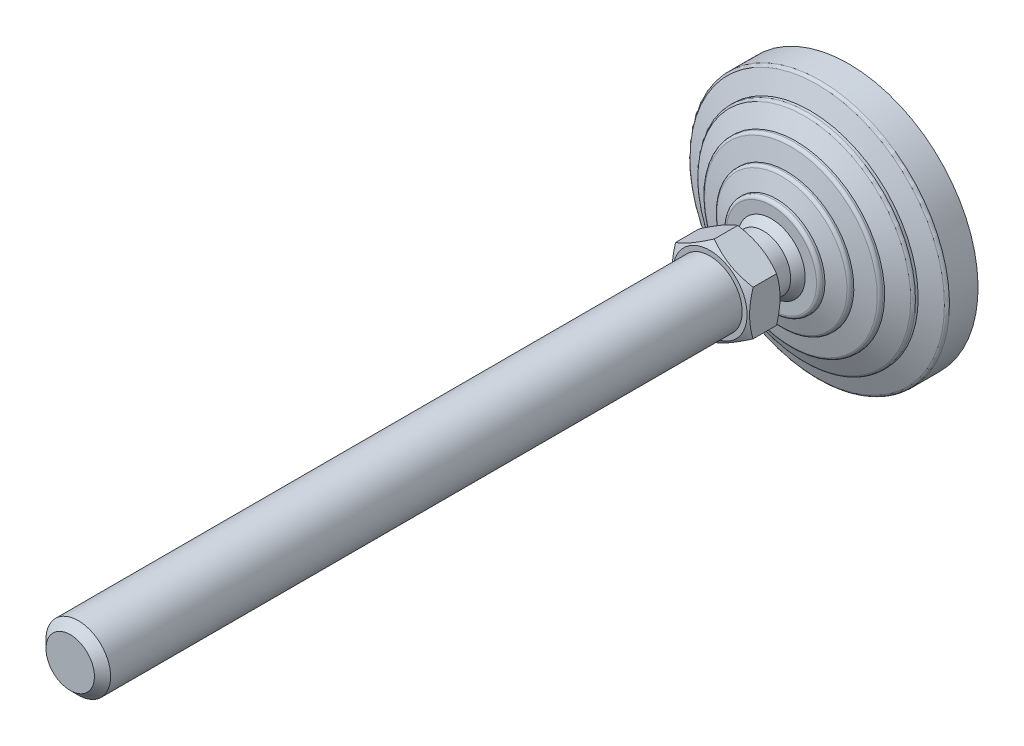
ISO-10303-21;
HEADER;
FILE_DESCRIPTION(('STEP AP214'),'2;1');
FILE_NAME('part.step','',(''),(''),'','','');
FILE_SCHEMA(('AUTOMOTIVE_DESIGN { 1 0 10303 214 1 1 1 1 }'));
ENDSEC;
DATA;
#1=APPLICATION_CONTEXT('core data for automotive mechanical design processes');
#2=APPLICATION_PROTOCOL_DEFINITION('international standard','automotive_design',2000,#1);
#3=PRODUCT_CONTEXT('',#1,'mechanical');
#4=PRODUCT('Part','Part','',(#3));
#5=PRODUCT_RELATED_PRODUCT_CATEGORY('part','',(#4));
#6=PRODUCT_DEFINITION_FORMATION('','',#4);
#7=PRODUCT_DEFINITION_CONTEXT('part definition',#1,'design');
#8=PRODUCT_DEFINITION('design','',#6,#7);
#9=PRODUCT_DEFINITION_SHAPE('','',#8);
#10=(LENGTH_UNIT() NAMED_UNIT(*) SI_UNIT(.MILLI.,.METRE.));
#11=(NAMED_UNIT(*) PLANE_ANGLE_UNIT() SI_UNIT($,.RADIAN.));
#12=(NAMED_UNIT(*) SI_UNIT($,.STERADIAN.) SOLID_ANGLE_UNIT());
#13=UNCERTAINTY_MEASURE_WITH_UNIT(LENGTH_MEASURE(1.E-05),#10,'distance_accuracy_value','');
#14=(GEOMETRIC_REPRESENTATION_CONTEXT(3) GLOBAL_UNCERTAINTY_ASSIGNED_CONTEXT((#13)) GLOBAL_UNIT_ASSIGNED_CONTEXT((#10,
#11,#12)) REPRESENTATION_CONTEXT('',''));
#15=CARTESIAN_POINT('',(0.,0.,0.));
#16=DIRECTION('',(0.,0.,1.));
#17=DIRECTION('',(1.,0.,0.));
#18=AXIS2_PLACEMENT_3D('',#15,#16,#17);
#19=CARTESIAN_POINT('',(-8.49999999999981,0.,32.9999999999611));
#20=DIRECTION('',(0.,0.,1.));
#21=DIRECTION('',(0.,-1.,0.));
#22=AXIS2_PLACEMENT_3D('',#19,#20,#21);
#23=PLANE('',#22);
#24=CARTESIAN_POINT('',(0.,0.,33.000000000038));
#25=DIRECTION('',(0.,0.,-1.));
#26=DIRECTION('',(-1.,0.,0.));
#27=AXIS2_PLACEMENT_3D('',#24,#25,#26);
#28=CIRCLE('',#27,11.5);
#29=CARTESIAN_POINT('',(-11.5,0.,33.000000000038));
#30=VERTEX_POINT('',#29);
#31=EDGE_CURVE('E570',#30,#30,#28,.T.);
#32=ORIENTED_EDGE('',*,*,#31,.T.);
#33=EDGE_LOOP('',(#32));
#34=FACE_BOUND('',#33,.T.);
#35=CARTESIAN_POINT('',(0.,0.,32.9999999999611));
#36=DIRECTION('',(0.,0.,-1.));
#37=DIRECTION('',(0.,1.,0.));
#38=AXIS2_PLACEMENT_3D('',#35,#36,#37);
#39=CIRCLE('',#38,8.49999999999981);
#40=CARTESIAN_POINT('',(0.,8.49999999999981,32.9999999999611));
#41=VERTEX_POINT('',#40);
#42=EDGE_CURVE('E150',#41,#41,#39,.T.);
#43=ORIENTED_EDGE('',*,*,#42,.F.);
#44=EDGE_LOOP('',(#43));
#45=FACE_BOUND('',#44,.T.);
#46=ADVANCED_FACE('F14',(#34,#45),#23,.F.);
#47=CARTESIAN_POINT('',(0.,0.,0.));
#48=DIRECTION('',(0.,0.,-1.));
#49=DIRECTION('',(0.,1.,0.));
#50=AXIS2_PLACEMENT_3D('',#47,#48,#49);
#51=CYLINDRICAL_SURFACE('',#50,8.49999999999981);
#52=CARTESIAN_POINT('',(0.,0.,26.4999999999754));
#53=DIRECTION('',(0.,0.,-1.));
#54=DIRECTION('',(0.,1.,0.));
#55=AXIS2_PLACEMENT_3D('',#52,#53,#54);
#56=CIRCLE('',#55,8.49999999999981);
#57=CARTESIAN_POINT('',(0.,8.49999999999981,26.4999999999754));
#58=VERTEX_POINT('',#57);
#59=EDGE_CURVE('E147',#58,#58,#56,.T.);
#60=ORIENTED_EDGE('',*,*,#59,.F.);
#61=EDGE_LOOP('',(#60));
#62=FACE_BOUND('',#61,.T.);
#63=ORIENTED_EDGE('',*,*,#42,.T.);
#64=EDGE_LOOP('',(#63));
#65=FACE_BOUND('',#64,.T.);
#66=ADVANCED_FACE('F174',(#62,#65),#51,.T.);
#67=CARTESIAN_POINT('',(-8.49107182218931,0.,26.4999999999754));
#68=DIRECTION('',(0.,0.,1.));
#69=DIRECTION('',(0.,-1.,0.));
#70=AXIS2_PLACEMENT_3D('',#67,#68,#69);
#71=PLANE('',#70);
#72=CARTESIAN_POINT('',(0.,0.,26.4999999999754));
#73=DIRECTION('',(0.,0.,-1.));
#74=DIRECTION('',(0.,1.,0.));
#75=AXIS2_PLACEMENT_3D('',#72,#73,#74);
#76=CIRCLE('',#75,8.49107182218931);
#77=CARTESIAN_POINT('',(-8.49107182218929,0.,26.4999999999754));
#78=VERTEX_POINT('',#77);
#79=EDGE_CURVE('E144',#78,#78,#76,.T.);
#80=ORIENTED_EDGE('',*,*,#79,.F.);
#81=EDGE_LOOP('',(#80));
#82=FACE_BOUND('',#81,.T.);
#83=ORIENTED_EDGE('',*,*,#59,.T.);
#84=EDGE_LOOP('',(#83));
#85=FACE_BOUND('',#84,.T.);
#86=ADVANCED_FACE('F181',(#82,#85),#71,.F.);
#87=CARTESIAN_POINT('',(-2.77555756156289E-12,0.,17.6702661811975));
#88=DIRECTION('',(0.,0.,-1.));
#89=DIRECTION('',(-1.,0.,0.));
#90=AXIS2_PLACEMENT_3D('',#87,#88,#89);
#91=SPHERICAL_SURFACE('',#90,12.25);
#92=CARTESIAN_POINT('',(0.,0.,24.));
#93=DIRECTION('',(0.,0.,-1.));
#94=DIRECTION('',(0.,1.,0.));
#95=AXIS2_PLACEMENT_3D('',#92,#93,#94);
#96=CIRCLE('',#95,10.4879440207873);
#97=CARTESIAN_POINT('',(-10.4879440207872,0.,24.));
#98=VERTEX_POINT('',#97);
#99=EDGE_CURVE('E141',#98,#98,#96,.T.);
#100=CARTESIAN_POINT('',(-10.4879440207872,0.,24.));
#101=CARTESIAN_POINT('',(-10.4706730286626,0.,24.0286168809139));
#102=CARTESIAN_POINT('',(-10.4532849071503,0.,24.0571630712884));
#103=CARTESIAN_POINT('',(-10.4182755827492,0.,24.1141121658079));
#104=CARTESIAN_POINT('',(-10.4006543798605,0.,24.1425150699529));
#105=CARTESIAN_POINT('',(-10.3651800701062,0.,24.1991756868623));
#106=CARTESIAN_POINT('',(-10.3473269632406,0.,24.2274333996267));
#107=CARTESIAN_POINT('',(-10.3113900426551,0.,24.283801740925));
#108=CARTESIAN_POINT('',(-10.2933062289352,0.,24.3119123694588));
#109=CARTESIAN_POINT('',(-10.2569091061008,0.,24.367984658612));
#110=CARTESIAN_POINT('',(-10.2385957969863,0.,24.3959463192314));
#111=CARTESIAN_POINT('',(-10.2017409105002,0.,24.4517187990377));
#112=CARTESIAN_POINT('',(-10.1831993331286,0.,24.4795296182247));
#113=CARTESIAN_POINT('',(-10.1458891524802,0.,24.5349985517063));
#114=CARTESIAN_POINT('',(-10.1271205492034,0.,24.5626566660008));
#115=CARTESIAN_POINT('',(-10.0893575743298,0.,24.6178183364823));
#116=CARTESIAN_POINT('',(-10.070363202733,0.,24.6453218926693));
#117=CARTESIAN_POINT('',(-10.0321499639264,0.,24.7001726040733));
#118=CARTESIAN_POINT('',(-10.0129310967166,0.,24.7275197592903));
#119=CARTESIAN_POINT('',(-9.97427015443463,0.,24.7820558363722));
#120=CARTESIAN_POINT('',(-9.95482807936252,0.,24.8092447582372));
#121=CARTESIAN_POINT('',(-9.91572202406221,0.,24.8634625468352));
#122=CARTESIAN_POINT('',(-9.89605804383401,0.,24.8904914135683));
#123=CARTESIAN_POINT('',(-9.85650949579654,0.,24.9443872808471));
#124=CARTESIAN_POINT('',(-9.83662492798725,0.,24.9712542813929));
#125=CARTESIAN_POINT('',(-9.79663653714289,0.,25.0248246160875));
#126=CARTESIAN_POINT('',(-9.77653271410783,0.,25.0515279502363));
#127=CARTESIAN_POINT('',(-9.73610715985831,0.,25.1047691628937));
#128=CARTESIAN_POINT('',(-9.71578542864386,0.,25.1313070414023));
#129=CARTESIAN_POINT('',(-9.67492541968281,0.,25.1842155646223));
#130=CARTESIAN_POINT('',(-9.65438714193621,0.,25.2105862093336));
#131=CARTESIAN_POINT('',(-9.61309541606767,0.,25.2631584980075));
#132=CARTESIAN_POINT('',(-9.59234196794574,0.,25.28936014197));
#133=CARTESIAN_POINT('',(-9.55062129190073,0.,25.3415926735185));
#134=CARTESIAN_POINT('',(-9.52965406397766,0.,25.3676235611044));
#135=CARTESIAN_POINT('',(-9.48750723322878,0.,25.4195128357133));
#136=CARTESIAN_POINT('',(-9.46632763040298,0.,25.4453712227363));
#137=CARTESIAN_POINT('',(-9.42375746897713,0.,25.4969137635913));
#138=CARTESIAN_POINT('',(-9.40236691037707,0.,25.5225979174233));
#139=CARTESIAN_POINT('',(-9.35937627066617,0.,25.5737902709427));
#140=CARTESIAN_POINT('',(-9.33777618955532,0.,25.5992984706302));
#141=CARTESIAN_POINT('',(-9.29436795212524,0.,25.6501372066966));
#142=CARTESIAN_POINT('',(-9.27255979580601,0.,25.6754677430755));
#143=CARTESIAN_POINT('',(-9.22873686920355,0.,25.7259494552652));
#144=CARTESIAN_POINT('',(-9.20672209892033,0.,25.751100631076));
#145=CARTESIAN_POINT('',(-9.16248741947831,0.,25.8012219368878));
#146=CARTESIAN_POINT('',(-9.14026751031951,0.,25.8261920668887));
#147=CARTESIAN_POINT('',(-9.0956240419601,0.,25.87594960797));
#148=CARTESIAN_POINT('',(-9.07320048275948,0.,25.9007370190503));
#149=CARTESIAN_POINT('',(-9.0281512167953,0.,25.9501274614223));
#150=CARTESIAN_POINT('',(-9.00552551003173,0.,25.9747304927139));
#151=CARTESIAN_POINT('',(-8.96007346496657,0.,26.023750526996));
#152=CARTESIAN_POINT('',(-8.93724712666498,0.,26.0481675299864));
#153=CARTESIAN_POINT('',(-8.8913953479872,0.,26.0968138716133));
#154=CARTESIAN_POINT('',(-8.868369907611,0.,26.1210432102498));
#155=CARTESIAN_POINT('',(-8.82212146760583,0.,26.1693125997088));
#156=CARTESIAN_POINT('',(-8.79889846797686,0.,26.1933526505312));
#157=CARTESIAN_POINT('',(-8.75225646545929,0.,26.2412418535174));
#158=CARTESIAN_POINT('',(-8.72883746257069,0.,26.2650910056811));
#159=CARTESIAN_POINT('',(-8.68180502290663,0.,26.3125968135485));
#160=CARTESIAN_POINT('',(-8.65819158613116,0.,26.3362534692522));
#161=CARTESIAN_POINT('',(-8.61077186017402,0.,26.383372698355));
#162=CARTESIAN_POINT('',(-8.58696557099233,0.,26.4068352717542));
#163=CARTESIAN_POINT('',(-8.53916173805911,0.,26.4535647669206));
#164=CARTESIAN_POINT('',(-8.51516419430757,0.,26.4768316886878));
#165=CARTESIAN_POINT('',(-8.49107182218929,0.,26.4999999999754));
#166=B_SPLINE_CURVE_WITH_KNOTS('',3,(#100,#101,#102,#103,#104,#105,#106,#107,#108,#109,#110,
#111,#112,#113,#114,#115,#116,#117,#118,#119,#120,#121,#122,#123,#124,#125,#126,#127,#128,#129,
#130,#131,#132,#133,#134,#135,#136,#137,#138,#139,#140,#141,#142,#143,#144,#145,#146,#147,#148,
#149,#150,#151,#152,#153,#154,#155,#156,#157,#158,#159,#160,#161,#162,#163,#164,#165),
.UNSPECIFIED.,.F.,.F.,(4,2,2,2,2,2,2,2,2,2,2,2,2,2,2,2,2,2,2,2,2,2,2,2,2,2,2,2,2,2,2,2,4),(0.,
0.100273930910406,0.20054786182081,0.30082179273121,0.401095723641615,0.501369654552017,
0.601643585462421,0.701917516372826,0.802191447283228,0.90246537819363,1.00273930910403,
1.10301324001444,1.20328717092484,1.30356110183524,1.40383503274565,1.50410896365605,
1.60438289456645,1.70465682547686,1.80493075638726,1.90520468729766,2.00547861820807,
2.10575254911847,2.20602648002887,2.30630041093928,2.40657434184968,2.50684827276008,
2.60712220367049,2.70739613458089,2.80767006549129,2.90794399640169,3.0082179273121,
3.1084918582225,3.2087657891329),.UNSPECIFIED.);
#167=EDGE_CURVE('BSEAM433',#98,#78,#166,.T.);
#168=ORIENTED_EDGE('',*,*,#99,.F.);
#169=ORIENTED_EDGE('',*,*,#79,.T.);
#170=ORIENTED_EDGE('',*,*,#167,.T.);
#171=ORIENTED_EDGE('',*,*,#167,.F.);
#172=EDGE_LOOP('',(#168,#170,#169,#171));
#173=FACE_BOUND('',#172,.T.);
#174=ADVANCED_FACE('F433',(#173),#91,.T.);
#175=CARTESIAN_POINT('',(-10.4879440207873,0.,24.));
#176=DIRECTION('',(0.,0.,-1.));
#177=DIRECTION('',(0.,1.,0.));
#178=AXIS2_PLACEMENT_3D('',#175,#176,#177);
#179=PLANE('',#178);
#180=CARTESIAN_POINT('',(0.,0.,24.));
#181=DIRECTION('',(0.,0.,-1.));
#182=DIRECTION('',(0.,1.,0.));
#183=AXIS2_PLACEMENT_3D('',#180,#181,#182);
#184=CIRCLE('',#183,13.9999999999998);
#185=CARTESIAN_POINT('',(0.,13.9999999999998,24.));
#186=VERTEX_POINT('',#185);
#187=EDGE_CURVE('E138',#186,#186,#184,.T.);
#188=ORIENTED_EDGE('',*,*,#187,.F.);
#189=EDGE_LOOP('',(#188));
#190=FACE_BOUND('',#189,.T.);
#191=ORIENTED_EDGE('',*,*,#99,.T.);
#192=EDGE_LOOP('',(#191));
#193=FACE_BOUND('',#192,.T.);
#194=ADVANCED_FACE('F423',(#190,#193),#179,.F.);
#195=CARTESIAN_POINT('',(0.,0.,23.));
#196=DIRECTION('',(0.,0.,-1.));
#197=DIRECTION('',(0.,1.,0.));
#198=AXIS2_PLACEMENT_3D('',#195,#196,#197);
#199=TOROIDAL_SURFACE('',#198,13.9999999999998,1.);
#200=CARTESIAN_POINT('',(0.,0.,23.));
#201=DIRECTION('',(0.,0.,-1.));
#202=DIRECTION('',(0.,1.,0.));
#203=AXIS2_PLACEMENT_3D('',#200,#201,#202);
#204=CIRCLE('',#203,14.9999999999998);
#205=CARTESIAN_POINT('',(0.,14.9999999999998,23.));
#206=VERTEX_POINT('',#205);
#207=EDGE_CURVE('E135',#206,#206,#204,.T.);
#208=ORIENTED_EDGE('',*,*,#207,.F.);
#209=EDGE_LOOP('',(#208));
#210=FACE_BOUND('',#209,.T.);
#211=ORIENTED_EDGE('',*,*,#187,.T.);
#212=EDGE_LOOP('',(#211));
#213=FACE_BOUND('',#212,.T.);
#214=ADVANCED_FACE('F413',(#210,#213),#199,.T.);
#215=CARTESIAN_POINT('',(0.,0.,0.));
#216=DIRECTION('',(0.,0.,-1.));
#217=DIRECTION('',(0.,1.,0.));
#218=AXIS2_PLACEMENT_3D('',#215,#216,#217);
#219=CYLINDRICAL_SURFACE('',#218,14.9999999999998);
#220=CARTESIAN_POINT('',(0.,0.,22.4025287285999));
#221=DIRECTION('',(0.,0.,-1.));
#222=DIRECTION('',(0.,1.,0.));
#223=AXIS2_PLACEMENT_3D('',#220,#221,#222);
#224=CIRCLE('',#223,14.9999999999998);
#225=CARTESIAN_POINT('',(0.,14.9999999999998,22.4025287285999));
#226=VERTEX_POINT('',#225);
#227=EDGE_CURVE('E132',#226,#226,#224,.T.);
#228=ORIENTED_EDGE('',*,*,#227,.F.);
#229=EDGE_LOOP('',(#228));
#230=FACE_BOUND('',#229,.T.);
#231=ORIENTED_EDGE('',*,*,#207,.T.);
#232=EDGE_LOOP('',(#231));
#233=FACE_BOUND('',#232,.T.);
#234=ADVANCED_FACE('F403',(#230,#233),#219,.T.);
#235=CARTESIAN_POINT('',(0.,0.,22.4025287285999));
#236=DIRECTION('',(0.,0.,-1.));
#237=DIRECTION('',(0.,1.,0.));
#238=AXIS2_PLACEMENT_3D('',#235,#236,#237);
#239=CONICAL_SURFACE('',#238,14.9999999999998,1.25589726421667);
#240=CARTESIAN_POINT('',(0.,0.,20.7216684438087));
#241=DIRECTION('',(0.,0.,-1.));
#242=DIRECTION('',(0.,1.,0.));
#243=AXIS2_PLACEMENT_3D('',#240,#241,#242);
#244=CIRCLE('',#243,20.1601635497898);
#245=CARTESIAN_POINT('',(0.,20.1601635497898,20.7216684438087));
#246=VERTEX_POINT('',#245);
#247=EDGE_CURVE('E129',#246,#246,#244,.T.);
#248=ORIENTED_EDGE('',*,*,#247,.F.);
#249=EDGE_LOOP('',(#248));
#250=FACE_BOUND('',#249,.T.);
#251=ORIENTED_EDGE('',*,*,#227,.T.);
#252=EDGE_LOOP('',(#251));
#253=FACE_BOUND('',#252,.T.);
#254=ADVANCED_FACE('F393',(#250,#253),#239,.T.);
#255=CARTESIAN_POINT('',(0.,0.,19.7708407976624));
#256=DIRECTION('',(0.,0.,-1.));
#257=DIRECTION('',(0.,1.,0.));
#258=AXIS2_PLACEMENT_3D('',#255,#256,#257);
#259=TOROIDAL_SURFACE('',#258,19.8504430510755,1.);
#260=CARTESIAN_POINT('',(0.,0.,19.7708407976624));
#261=DIRECTION('',(0.,0.,-1.));
#262=DIRECTION('',(0.,1.,0.));
#263=AXIS2_PLACEMENT_3D('',#260,#261,#262);
#264=CIRCLE('',#263,20.8504430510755);
#265=CARTESIAN_POINT('',(0.,20.8504430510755,19.7708407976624));
#266=VERTEX_POINT('',#265);
#267=EDGE_CURVE('E126',#266,#266,#264,.T.);
#268=ORIENTED_EDGE('',*,*,#267,.F.);
#269=EDGE_LOOP('',(#268));
#270=FACE_BOUND('',#269,.T.);
#271=ORIENTED_EDGE('',*,*,#247,.T.);
#272=EDGE_LOOP('',(#271));
#273=FACE_BOUND('',#272,.T.);
#274=ADVANCED_FACE('F383',(#270,#273),#259,.T.);
#275=CARTESIAN_POINT('',(0.,0.,0.));
#276=DIRECTION('',(0.,0.,-1.));
#277=DIRECTION('',(0.,1.,0.));
#278=AXIS2_PLACEMENT_3D('',#275,#276,#277);
#279=CYLINDRICAL_SURFACE('',#278,20.8504430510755);
#280=CARTESIAN_POINT('',(0.,0.,19.2987385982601));
#281=DIRECTION('',(0.,0.,-1.));
#282=DIRECTION('',(0.,1.,0.));
#283=AXIS2_PLACEMENT_3D('',#280,#281,#282);
#284=CIRCLE('',#283,20.8504430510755);
#285=CARTESIAN_POINT('',(0.,20.8504430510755,19.2987385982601));
#286=VERTEX_POINT('',#285);
#287=EDGE_CURVE('E123',#286,#286,#284,.T.);
#288=ORIENTED_EDGE('',*,*,#287,.F.);
#289=EDGE_LOOP('',(#288));
#290=FACE_BOUND('',#289,.T.);
#291=ORIENTED_EDGE('',*,*,#267,.T.);
#292=EDGE_LOOP('',(#291));
#293=FACE_BOUND('',#292,.T.);
#294=ADVANCED_FACE('F373',(#290,#293),#279,.T.);
#295=CARTESIAN_POINT('',(0.,0.,19.2987385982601));
#296=DIRECTION('',(0.,0.,-1.));
#297=DIRECTION('',(0.,1.,0.));
#298=AXIS2_PLACEMENT_3D('',#295,#296,#297);
#299=CONICAL_SURFACE('',#298,20.8504430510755,1.34067144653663);
#300=CARTESIAN_POINT('',(0.,0.,17.9217501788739));
#301=DIRECTION('',(0.,0.,-1.));
#302=DIRECTION('',(0.,1.,0.));
#303=AXIS2_PLACEMENT_3D('',#300,#301,#302);
#304=CIRCLE('',#303,26.7280991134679);
#305=CARTESIAN_POINT('',(0.,26.7280991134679,17.9217501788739));
#306=VERTEX_POINT('',#305);
#307=EDGE_CURVE('E120',#306,#306,#304,.T.);
#308=ORIENTED_EDGE('',*,*,#307,.F.);
#309=EDGE_LOOP('',(#308));
#310=FACE_BOUND('',#309,.T.);
#311=ORIENTED_EDGE('',*,*,#287,.T.);
#312=EDGE_LOOP('',(#311));
#313=FACE_BOUND('',#312,.T.);
#314=ADVANCED_FACE('F363',(#310,#313),#299,.T.);
#315=CARTESIAN_POINT('',(0.,0.,16.9481122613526));
#316=DIRECTION('',(0.,0.,-1.));
#317=DIRECTION('',(0.,1.,0.));
#318=AXIS2_PLACEMENT_3D('',#315,#316,#317);
#319=TOROIDAL_SURFACE('',#318,26.5,1.00000000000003);
#320=CARTESIAN_POINT('',(0.,0.,16.9481122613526));
#321=DIRECTION('',(0.,0.,-1.));
#322=DIRECTION('',(0.,1.,0.));
#323=AXIS2_PLACEMENT_3D('',#320,#321,#322);
#324=CIRCLE('',#323,27.5);
#325=CARTESIAN_POINT('',(0.,27.5,16.9481122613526));
#326=VERTEX_POINT('',#325);
#327=EDGE_CURVE('E117',#326,#326,#324,.T.);
#328=ORIENTED_EDGE('',*,*,#327,.F.);
#329=EDGE_LOOP('',(#328));
#330=FACE_BOUND('',#329,.T.);
#331=ORIENTED_EDGE('',*,*,#307,.T.);
#332=EDGE_LOOP('',(#331));
#333=FACE_BOUND('',#332,.T.);
#334=ADVANCED_FACE('F353',(#330,#333),#319,.T.);
#335=CARTESIAN_POINT('',(0.,0.,0.));
#336=DIRECTION('',(0.,0.,-1.));
#337=DIRECTION('',(0.,1.,0.));
#338=AXIS2_PLACEMENT_3D('',#335,#336,#337);
#339=CYLINDRICAL_SURFACE('',#338,27.5);
#340=CARTESIAN_POINT('',(0.,0.,16.4025287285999));
#341=DIRECTION('',(0.,0.,-1.));
#342=DIRECTION('',(0.,1.,0.));
#343=AXIS2_PLACEMENT_3D('',#340,#341,#342);
#344=CIRCLE('',#343,27.5);
#345=CARTESIAN_POINT('',(0.,27.5,16.4025287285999));
#346=VERTEX_POINT('',#345);
#347=EDGE_CURVE('E114',#346,#346,#344,.T.);
#348=ORIENTED_EDGE('',*,*,#347,.F.);
#349=EDGE_LOOP('',(#348));
#350=FACE_BOUND('',#349,.T.);
#351=ORIENTED_EDGE('',*,*,#327,.T.);
#352=EDGE_LOOP('',(#351));
#353=FACE_BOUND('',#352,.T.);
#354=ADVANCED_FACE('F343',(#350,#353),#339,.T.);
#355=CARTESIAN_POINT('',(0.,0.,16.4025287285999));
#356=DIRECTION('',(0.,0.,-1.));
#357=DIRECTION('',(0.,1.,0.));
#358=AXIS2_PLACEMENT_3D('',#355,#356,#357);
#359=CONICAL_SURFACE('',#358,27.5,1.1202291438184);
#360=CARTESIAN_POINT('',(0.,0.,13.7730910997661));
#361=DIRECTION('',(0.,0.,-1.));
#362=DIRECTION('',(0.,1.,0.));
#363=AXIS2_PLACEMENT_3D('',#360,#361,#362);
#364=CIRCLE('',#363,32.935476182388);
#365=CARTESIAN_POINT('',(0.,32.935476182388,13.7730910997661));
#366=VERTEX_POINT('',#365);
#367=EDGE_CURVE('E111',#366,#366,#364,.T.);
#368=ORIENTED_EDGE('',*,*,#367,.F.);
#369=EDGE_LOOP('',(#368));
#370=FACE_BOUND('',#369,.T.);
#371=ORIENTED_EDGE('',*,*,#347,.T.);
#372=EDGE_LOOP('',(#371));
#373=FACE_BOUND('',#372,.T.);
#374=ADVANCED_FACE('F333',(#370,#373),#359,.T.);
#375=CARTESIAN_POINT('',(0.,0.,12.8728908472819));
#376=DIRECTION('',(0.,0.,-1.));
#377=DIRECTION('',(0.,1.,0.));
#378=AXIS2_PLACEMENT_3D('',#375,#376,#377);
#379=TOROIDAL_SURFACE('',#378,32.5,0.999999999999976);
#380=CARTESIAN_POINT('',(0.,0.,12.8728908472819));
#381=DIRECTION('',(0.,0.,-1.));
#382=DIRECTION('',(0.,1.,0.));
#383=AXIS2_PLACEMENT_3D('',#380,#381,#382);
#384=CIRCLE('',#383,33.5);
#385=CARTESIAN_POINT('',(0.,33.5,12.8728908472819));
#386=VERTEX_POINT('',#385);
#387=EDGE_CURVE('E108',#386,#386,#384,.T.);
#388=ORIENTED_EDGE('',*,*,#387,.F.);
#389=EDGE_LOOP('',(#388));
#390=FACE_BOUND('',#389,.T.);
#391=ORIENTED_EDGE('',*,*,#367,.T.);
#392=EDGE_LOOP('',(#391));
#393=FACE_BOUND('',#392,.T.);
#394=ADVANCED_FACE('F323',(#390,#393),#379,.T.);
#395=CARTESIAN_POINT('',(0.,0.,0.));
#396=DIRECTION('',(0.,0.,-1.));
#397=DIRECTION('',(0.,1.,0.));
#398=AXIS2_PLACEMENT_3D('',#395,#396,#397);
#399=CYLINDRICAL_SURFACE('',#398,33.5);
#400=CARTESIAN_POINT('',(0.,0.,12.0315037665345));
#401=DIRECTION('',(0.,0.,-1.));
#402=DIRECTION('',(0.,1.,0.));
#403=AXIS2_PLACEMENT_3D('',#400,#401,#402);
#404=CIRCLE('',#403,33.5);
#405=CARTESIAN_POINT('',(0.,33.5,12.0315037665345));
#406=VERTEX_POINT('',#405);
#407=EDGE_CURVE('E105',#406,#406,#404,.T.);
#408=ORIENTED_EDGE('',*,*,#407,.F.);
#409=EDGE_LOOP('',(#408));
#410=FACE_BOUND('',#409,.T.);
#411=ORIENTED_EDGE('',*,*,#387,.T.);
#412=EDGE_LOOP('',(#411));
#413=FACE_BOUND('',#412,.T.);
#414=ADVANCED_FACE('F313',(#410,#413),#399,.T.);
#415=CARTESIAN_POINT('',(0.,0.,12.0315037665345));
#416=DIRECTION('',(0.,0.,-1.));
#417=DIRECTION('',(0.,1.,0.));
#418=AXIS2_PLACEMENT_3D('',#415,#416,#417);
#419=CONICAL_SURFACE('',#418,33.5,1.20362249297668);
#420=CARTESIAN_POINT('',(0.,0.,9.77805027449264));
#421=DIRECTION('',(0.,0.,-1.));
#422=DIRECTION('',(0.,1.,0.));
#423=AXIS2_PLACEMENT_3D('',#420,#421,#422);
#424=CIRCLE('',#423,39.3589790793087);
#425=CARTESIAN_POINT('',(0.,39.3589790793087,9.77805027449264));
#426=VERTEX_POINT('',#425);
#427=EDGE_CURVE('E102',#426,#426,#424,.T.);
#428=ORIENTED_EDGE('',*,*,#427,.F.);
#429=EDGE_LOOP('',(#428));
#430=FACE_BOUND('',#429,.T.);
#431=ORIENTED_EDGE('',*,*,#407,.T.);
#432=EDGE_LOOP('',(#431));
#433=FACE_BOUND('',#432,.T.);
#434=ADVANCED_FACE('F303',(#430,#433),#419,.T.);
#435=CARTESIAN_POINT('',(0.,0.,8.84470466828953));
#436=DIRECTION('',(0.,0.,-1.));
#437=DIRECTION('',(0.,1.,0.));
#438=AXIS2_PLACEMENT_3D('',#435,#436,#437);
#439=TOROIDAL_SURFACE('',#438,39.,1.00000000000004);
#440=CARTESIAN_POINT('',(0.,0.,8.84470466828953));
#441=DIRECTION('',(0.,0.,-1.));
#442=DIRECTION('',(0.,1.,0.));
#443=AXIS2_PLACEMENT_3D('',#440,#441,#442);
#444=CIRCLE('',#443,40.);
#445=CARTESIAN_POINT('',(0.,40.,8.84470466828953));
#446=VERTEX_POINT('',#445);
#447=EDGE_CURVE('E99',#446,#446,#444,.T.);
#448=ORIENTED_EDGE('',*,*,#447,.F.);
#449=EDGE_LOOP('',(#448));
#450=FACE_BOUND('',#449,.T.);
#451=ORIENTED_EDGE('',*,*,#427,.T.);
#452=EDGE_LOOP('',(#451));
#453=FACE_BOUND('',#452,.T.);
#454=ADVANCED_FACE('F293',(#450,#453),#439,.T.);
#455=CARTESIAN_POINT('',(0.,0.,0.));
#456=DIRECTION('',(0.,0.,-1.));
#457=DIRECTION('',(0.,1.,0.));
#458=AXIS2_PLACEMENT_3D('',#455,#456,#457);
#459=CYLINDRICAL_SURFACE('',#458,40.);
#460=CARTESIAN_POINT('',(0.,0.,0.));
#461=DIRECTION('',(0.,0.,-1.));
#462=DIRECTION('',(0.,1.,0.));
#463=AXIS2_PLACEMENT_3D('',#460,#461,#462);
#464=CIRCLE('',#463,40.);
#465=CARTESIAN_POINT('',(0.,40.,0.));
#466=VERTEX_POINT('',#465);
#467=EDGE_CURVE('E96',#466,#466,#464,.T.);
#468=ORIENTED_EDGE('',*,*,#467,.F.);
#469=EDGE_LOOP('',(#468));
#470=FACE_BOUND('',#469,.T.);
#471=ORIENTED_EDGE('',*,*,#447,.T.);
#472=EDGE_LOOP('',(#471));
#473=FACE_BOUND('',#472,.T.);
#474=ADVANCED_FACE('F282',(#470,#473),#459,.T.);
#475=CARTESIAN_POINT('',(0.,0.,0.));
#476=DIRECTION('',(0.,0.,1.));
#477=DIRECTION('',(0.,-1.,0.));
#478=AXIS2_PLACEMENT_3D('',#475,#476,#477);
#479=PLANE('',#478);
#480=ORIENTED_EDGE('',*,*,#467,.T.);
#481=EDGE_LOOP('',(#480));
#482=FACE_BOUND('',#481,.T.);
#483=ADVANCED_FACE('F172',(#482),#479,.F.);
#484=CARTESIAN_POINT('',(0.,0.,36.1874329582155));
#485=DIRECTION('',(0.,0.,1.));
#486=DIRECTION('',(1.,0.,0.));
#487=AXIS2_PLACEMENT_3D('',#484,#485,#486);
#488=CONICAL_SURFACE('',#487,17.020795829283,1.0471975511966);
#489=CARTESIAN_POINT('',(0.000200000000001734,-13.8565219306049,34.3605385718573));
#490=CARTESIAN_POINT('',(-0.263585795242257,-13.7042251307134,34.2726247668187));
#491=CARTESIAN_POINT('',(-0.528355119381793,-13.5513604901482,34.1887011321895));
#492=CARTESIAN_POINT('',(-1.06001701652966,-13.2444053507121,34.0299413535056));
#493=CARTESIAN_POINT('',(-1.32691025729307,-13.0903144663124,33.9551081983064));
#494=CARTESIAN_POINT('',(-2.13189040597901,-12.6255589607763,33.745692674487));
#495=CARTESIAN_POINT('',(-2.6731550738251,-12.3130596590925,33.6265783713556));
#496=CARTESIAN_POINT('',(-3.48313282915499,-11.8454187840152,33.4869061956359));
#497=CARTESIAN_POINT('',(-3.74942610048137,-11.6916742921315,33.4471189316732));
#498=CARTESIAN_POINT('',(-4.28324559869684,-11.3834734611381,33.3803985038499));
#499=CARTESIAN_POINT('',(-4.55077184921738,-11.2290171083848,33.3534655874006));
#500=CARTESIAN_POINT('',(-5.08627036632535,-10.9198468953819,33.3131437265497));
#501=CARTESIAN_POINT('',(-5.35424172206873,-10.7651335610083,33.2997386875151));
#502=CARTESIAN_POINT('',(-5.89043273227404,-10.4555635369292,33.28675822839));
#503=CARTESIAN_POINT('',(-6.15865237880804,-10.3007068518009,33.2871823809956));
#504=CARTESIAN_POINT('',(-6.66008937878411,-10.0112020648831,33.3008951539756));
#505=CARTESIAN_POINT('',(-6.89334249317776,-9.87653331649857,33.3125111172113));
#506=CARTESIAN_POINT('',(-7.35931224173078,-9.60750555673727,33.3459831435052));
#507=CARTESIAN_POINT('',(-7.59202883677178,-9.47314656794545,33.367839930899));
#508=CARTESIAN_POINT('',(-8.05679907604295,-9.20481134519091,33.4214125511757));
#509=CARTESIAN_POINT('',(-8.28885201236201,-9.07083551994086,33.4531365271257));
#510=CARTESIAN_POINT('',(-8.75186996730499,-8.8035119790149,33.5258869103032));
#511=CARTESIAN_POINT('',(-8.98283491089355,-8.67016430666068,33.566913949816));
#512=CARTESIAN_POINT('',(-9.68394195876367,-8.26537996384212,33.7049867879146));
#513=CARTESIAN_POINT('',(-10.1520537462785,-7.99511549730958,33.8158000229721));
#514=CARTESIAN_POINT('',(-11.0812971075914,-7.45861659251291,34.0673009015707));
#515=CARTESIAN_POINT('',(-11.5424405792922,-7.19237528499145,34.2079294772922));
#516=CARTESIAN_POINT('',(-12.0002,-6.92808776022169,34.3605385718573));
#517=B_SPLINE_CURVE_WITH_KNOTS('',3,(#489,#490,#491,#492,#493,#494,#495,#496,#497,#498,#499,
#500,#501,#502,#503,#504,#505,#506,#507,#508,#509,#510,#511,#512,#513,#514,#515,#516),
.UNSPECIFIED.,.F.,.F.,(4,2,2,2,2,2,2,2,2,2,2,2,2,4),(0.,0.951004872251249,1.90232158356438,
3.80900466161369,4.73894551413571,5.6689042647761,6.59775529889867,7.52657763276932,
8.3351464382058,9.14377244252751,9.95306755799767,10.7624176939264,12.4167102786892,
14.0677556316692),.UNSPECIFIED.);
#518=CARTESIAN_POINT('',(0.,-13.856406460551,34.3604719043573));
#519=VERTEX_POINT('',#518);
#520=CARTESIAN_POINT('',(-12.,-6.92820323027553,34.3604719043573));
#521=VERTEX_POINT('',#520);
#522=EDGE_CURVE('E73',#519,#521,#517,.T.);
#523=ORIENTED_EDGE('',*,*,#522,.T.);
#524=CARTESIAN_POINT('',(-12.,-18.5888387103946,39.1347288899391));
#525=CARTESIAN_POINT('',(-12.,-18.3268754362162,39.0076635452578));
#526=CARTESIAN_POINT('',(-12.,-18.0646041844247,38.881233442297));
#527=CARTESIAN_POINT('',(-12.,-17.5393814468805,38.6297876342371));
#528=CARTESIAN_POINT('',(-12.,-17.2764299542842,38.5047719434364));
#529=CARTESIAN_POINT('',(-12.,-16.4863883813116,38.1320292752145));
#530=CARTESIAN_POINT('',(-12.,-15.9581890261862,37.886644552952));
#531=CARTESIAN_POINT('',(-12.,-14.8953638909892,37.4022833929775));
#532=CARTESIAN_POINT('',(-12.,-14.3607187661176,37.163349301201));
#533=CARTESIAN_POINT('',(-12.,-13.2871692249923,36.6952836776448));
#534=CARTESIAN_POINT('',(-12.,-12.7482650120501,36.4661516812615));
#535=CARTESIAN_POINT('',(-12.,-11.6480344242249,36.0131597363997));
#536=CARTESIAN_POINT('',(-12.,-11.0865416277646,35.7897018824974));
#537=CARTESIAN_POINT('',(-12.,-9.95697515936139,35.3597488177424));
#538=CARTESIAN_POINT('',(-12.,-9.3889007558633,35.153255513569));
#539=CARTESIAN_POINT('',(-12.,-8.24635599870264,34.7626708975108));
#540=CARTESIAN_POINT('',(-12.,-7.67190133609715,34.5785340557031));
#541=CARTESIAN_POINT('',(-12.,-6.51469731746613,34.2385747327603));
#542=CARTESIAN_POINT('',(-12.,-5.9319506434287,34.0827433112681));
#543=CARTESIAN_POINT('',(-12.,-5.05311978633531,33.8762995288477));
#544=CARTESIAN_POINT('',(-12.,-4.76019085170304,33.8121726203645));
#545=CARTESIAN_POINT('',(-12.,-4.17233538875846,33.6937864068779));
#546=CARTESIAN_POINT('',(-12.,-3.87740890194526,33.6395268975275));
#547=CARTESIAN_POINT('',(-12.,-3.28576304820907,33.5418345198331));
#548=CARTESIAN_POINT('',(-12.,-2.98904370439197,33.4984015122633));
#549=CARTESIAN_POINT('',(-12.,-2.3941285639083,33.4232294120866));
#550=CARTESIAN_POINT('',(-12.,-2.09593282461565,33.3914898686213));
#551=CARTESIAN_POINT('',(-12.,-1.50236601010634,33.3407320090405));
#552=CARTESIAN_POINT('',(-12.,-1.20700872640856,33.3215533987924));
#553=CARTESIAN_POINT('',(-12.,-0.615748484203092,33.2957021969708));
#554=CARTESIAN_POINT('',(-12.,-0.319845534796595,33.2890293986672));
#555=CARTESIAN_POINT('',(-12.,0.271978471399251,33.288348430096));
#556=CARTESIAN_POINT('',(-12.,0.567899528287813,33.2943403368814));
#557=CARTESIAN_POINT('',(-12.,1.15922640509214,33.3188430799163));
#558=CARTESIAN_POINT('',(-12.,1.45463220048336,33.3373544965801));
#559=CARTESIAN_POINT('',(-12.,2.16521364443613,33.3965488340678));
#560=CARTESIAN_POINT('',(-12.,2.5799002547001,33.4432066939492));
#561=CARTESIAN_POINT('',(-12.,3.40618442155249,33.5586475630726));
#562=CARTESIAN_POINT('',(-12.,3.81778154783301,33.6274335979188));
#563=CARTESIAN_POINT('',(-12.,4.63749782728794,33.7846838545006));
#564=CARTESIAN_POINT('',(-12.,5.04561400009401,33.8731634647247));
#565=CARTESIAN_POINT('',(-12.,5.85774691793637,34.0671022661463));
#566=CARTESIAN_POINT('',(-12.,6.26176372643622,34.1725611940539));
#567=CARTESIAN_POINT('',(-12.,7.07459393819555,34.4003895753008));
#568=CARTESIAN_POINT('',(-12.,7.48331653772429,34.5230807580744));
#569=CARTESIAN_POINT('',(-12.,8.29673495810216,34.7810877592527));
#570=CARTESIAN_POINT('',(-12.,8.70143075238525,34.9164036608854));
#571=CARTESIAN_POINT('',(-12.,9.50699675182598,35.1975160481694));
#572=CARTESIAN_POINT('',(-12.,9.90786819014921,35.3433090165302));
#573=CARTESIAN_POINT('',(-12.,10.7062924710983,35.6436653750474));
#574=CARTESIAN_POINT('',(-12.,11.1038453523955,35.7982286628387));
#575=CARTESIAN_POINT('',(-12.,12.0413567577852,36.1727303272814));
#576=CARTESIAN_POINT('',(-12.,12.580043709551,36.3958471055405));
#577=CARTESIAN_POINT('',(-12.,13.652848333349,36.8528391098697));
#578=CARTESIAN_POINT('',(-12.,14.1869657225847,37.0867149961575));
#579=CARTESIAN_POINT('',(-12.,15.2514828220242,37.5630701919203));
#580=CARTESIAN_POINT('',(-12.,15.7818816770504,37.8055514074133));
#581=CARTESIAN_POINT('',(-12.,16.8394640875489,38.2973811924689));
#582=CARTESIAN_POINT('',(-12.,17.3666477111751,38.5467296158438));
#583=CARTESIAN_POINT('',(-12.,18.4189069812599,39.0512847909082));
#584=CARTESIAN_POINT('',(-12.,18.9439796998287,39.3064976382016));
#585=CARTESIAN_POINT('',(-12.,19.9918670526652,39.8215169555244));
#586=CARTESIAN_POINT('',(-12.,20.5146816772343,40.081323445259));
#587=CARTESIAN_POINT('',(-12.,21.5583329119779,40.6047090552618));
#588=CARTESIAN_POINT('',(-12.,22.0791697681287,40.8682876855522));
#589=CARTESIAN_POINT('',(-12.,23.1192185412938,41.3986333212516));
#590=CARTESIAN_POINT('',(-12.,23.6384304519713,41.665400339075));
#591=CARTESIAN_POINT('',(-12.,25.107051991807,42.4247674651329));
#592=CARTESIAN_POINT('',(-12.,26.0548291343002,42.9205247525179));
#593=CARTESIAN_POINT('',(-12.,27.9468715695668,43.918760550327));
#594=CARTESIAN_POINT('',(-12.,28.8911367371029,44.4212392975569));
#595=CARTESIAN_POINT('',(-12.,30.7745728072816,45.4300914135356));
#596=CARTESIAN_POINT('',(-12.,31.7137505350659,45.9364520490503));
#597=CARTESIAN_POINT('',(-12.,33.1208605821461,46.6989851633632));
#598=CARTESIAN_POINT('',(-12.,33.5896085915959,46.9536546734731));
#599=CARTESIAN_POINT('',(-12.,34.5266149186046,47.4638913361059));
#600=CARTESIAN_POINT('',(-12.,34.9948732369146,47.7194584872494));
#601=CARTESIAN_POINT('',(-12.,35.4629144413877,47.9754227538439));
#602=B_SPLINE_CURVE_WITH_KNOTS('',3,(#524,#525,#526,#527,#528,#529,#530,#531,#532,#533,#534,
#535,#536,#537,#538,#539,#540,#541,#542,#543,#544,#545,#546,#547,#548,#549,#550,#551,#552,#553,
#554,#555,#556,#557,#558,#559,#560,#561,#562,#563,#564,#565,#566,#567,#568,#569,#570,#571,#572,
#573,#574,#575,#576,#577,#578,#579,#580,#581,#582,#583,#584,#585,#586,#587,#588,#589,#590,#591,
#592,#593,#594,#595,#596,#597,#598,#599,#600,#601),.UNSPECIFIED.,.F.,.F.,(4,2,2,2,2,2,2,2,2,2,2,
2,2,2,2,2,2,2,2,2,2,2,2,2,2,2,2,2,2,2,2,2,2,2,2,2,2,2,4),(0.,0.873458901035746,1.74692662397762,
3.49412166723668,5.25086435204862,7.00752367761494,8.82028657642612,10.6332529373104,
12.4424628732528,14.2511003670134,15.15055906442,16.0499991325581,16.9494276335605,
17.8488214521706,18.7365018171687,19.6241675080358,20.5118385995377,21.399550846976,
22.6507676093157,23.9021555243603,25.154524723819,26.4068745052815,27.6868515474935,
28.9668370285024,30.2463947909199,31.5259376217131,33.2749736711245,35.0241171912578,
36.7736505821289,38.5231467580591,40.2745519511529,42.0259646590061,43.777151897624,
45.5283459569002,48.7371228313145,51.9460130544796,55.1469532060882,56.7473372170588,
58.3477187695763),.UNSPECIFIED.);
#603=CARTESIAN_POINT('',(-12.,6.92820323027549,34.3604719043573));
#604=VERTEX_POINT('',#603);
#605=EDGE_CURVE('E81',#521,#604,#602,.T.);
#606=ORIENTED_EDGE('',*,*,#605,.T.);
#607=CARTESIAN_POINT('',(-12.0002,6.92808776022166,34.3605385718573));
#608=CARTESIAN_POINT('',(-11.7364142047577,7.08038456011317,34.2726247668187));
#609=CARTESIAN_POINT('',(-11.4716448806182,7.23324920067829,34.1887011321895));
#610=CARTESIAN_POINT('',(-10.9399829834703,7.54020434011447,34.0299413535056));
#611=CARTESIAN_POINT('',(-10.6730897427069,7.69429522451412,33.9551081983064));
#612=CARTESIAN_POINT('',(-9.86810959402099,8.15905073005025,33.7456926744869));
#613=CARTESIAN_POINT('',(-9.32684492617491,8.47155003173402,33.6265783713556));
#614=CARTESIAN_POINT('',(-8.51686717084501,8.93919090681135,33.4869061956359));
#615=CARTESIAN_POINT('',(-8.25057389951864,9.09293539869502,33.4471189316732));
#616=CARTESIAN_POINT('',(-7.71675440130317,9.40113622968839,33.3803985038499));
#617=CARTESIAN_POINT('',(-7.44922815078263,9.55559258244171,33.3534655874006));
#618=CARTESIAN_POINT('',(-6.91372963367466,9.86476279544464,33.3131437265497));
#619=CARTESIAN_POINT('',(-6.64575827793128,10.0194761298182,33.2997386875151));
#620=CARTESIAN_POINT('',(-6.10956726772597,10.3290461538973,33.28675822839));
#621=CARTESIAN_POINT('',(-5.84134762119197,10.4839028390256,33.2871823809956));
#622=CARTESIAN_POINT('',(-5.3399106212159,10.7734076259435,33.3008951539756));
#623=CARTESIAN_POINT('',(-5.10665750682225,10.908076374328,33.3125111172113));
#624=CARTESIAN_POINT('',(-4.64068775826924,11.1771041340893,33.3459831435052));
#625=CARTESIAN_POINT('',(-4.40797116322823,11.3114631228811,33.367839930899));
#626=CARTESIAN_POINT('',(-3.94320092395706,11.5797983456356,33.4214125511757));
#627=CARTESIAN_POINT('',(-3.711147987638,11.7137741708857,33.4531365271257));
#628=CARTESIAN_POINT('',(-3.24813003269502,11.9810977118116,33.5258869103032));
#629=CARTESIAN_POINT('',(-3.01716508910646,12.1144453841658,33.566913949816));
#630=CARTESIAN_POINT('',(-2.31605804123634,12.5192297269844,33.7049867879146));
#631=CARTESIAN_POINT('',(-1.84794625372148,12.7894941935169,33.8158000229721));
#632=CARTESIAN_POINT('',(-0.918702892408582,13.3259930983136,34.0673009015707));
#633=CARTESIAN_POINT('',(-0.457559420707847,13.5922344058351,34.2079294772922));
#634=CARTESIAN_POINT('',(0.000199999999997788,13.8565219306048,34.3605385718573));
#635=B_SPLINE_CURVE_WITH_KNOTS('',3,(#607,#608,#609,#610,#611,#612,#613,#614,#615,#616,#617,
#618,#619,#620,#621,#622,#623,#624,#625,#626,#627,#628,#629,#630,#631,#632,#633,#634),
.UNSPECIFIED.,.F.,.F.,(4,2,2,2,2,2,2,2,2,2,2,2,2,4),(0.,0.951004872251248,1.90232158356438,
3.80900466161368,4.7389455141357,5.66890426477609,6.59775529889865,7.5265776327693,
8.33514643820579,9.14377244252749,9.95306755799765,10.7624176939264,12.4167102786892,
14.0677556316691),.UNSPECIFIED.);
#636=CARTESIAN_POINT('',(0.,13.856406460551,34.3604719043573));
#637=VERTEX_POINT('',#636);
#638=EDGE_CURVE('E525',#604,#637,#635,.T.);
#639=ORIENTED_EDGE('',*,*,#638,.T.);
#640=CARTESIAN_POINT('',(-0.000200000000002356,13.8565219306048,34.3605385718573));
#641=CARTESIAN_POINT('',(0.263585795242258,13.7042251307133,34.2726247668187));
#642=CARTESIAN_POINT('',(0.528355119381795,13.5513604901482,34.1887011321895));
#643=CARTESIAN_POINT('',(1.06001701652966,13.244405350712,34.0299413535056));
#644=CARTESIAN_POINT('',(1.32691025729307,13.0903144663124,33.9551081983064));
#645=CARTESIAN_POINT('',(2.131890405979,12.6255589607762,33.7456926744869));
#646=CARTESIAN_POINT('',(2.67315507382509,12.3130596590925,33.6265783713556));
#647=CARTESIAN_POINT('',(3.48313282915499,11.8454187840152,33.4869061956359));
#648=CARTESIAN_POINT('',(3.74942610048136,11.6916742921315,33.4471189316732));
#649=CARTESIAN_POINT('',(4.28324559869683,11.3834734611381,33.3803985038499));
#650=CARTESIAN_POINT('',(4.55077184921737,11.2290171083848,33.3534655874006));
#651=CARTESIAN_POINT('',(5.08627036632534,10.9198468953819,33.3131437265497));
#652=CARTESIAN_POINT('',(5.35424172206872,10.7651335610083,33.2997386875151));
#653=CARTESIAN_POINT('',(5.89043273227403,10.4555635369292,33.28675822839));
#654=CARTESIAN_POINT('',(6.15865237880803,10.3007068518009,33.2871823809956));
#655=CARTESIAN_POINT('',(6.6600893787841,10.011202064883,33.3008951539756));
#656=CARTESIAN_POINT('',(6.89334249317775,9.87653331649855,33.3125111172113));
#657=CARTESIAN_POINT('',(7.35931224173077,9.60750555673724,33.3459831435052));
#658=CARTESIAN_POINT('',(7.59202883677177,9.47314656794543,33.367839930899));
#659=CARTESIAN_POINT('',(8.05679907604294,9.20481134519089,33.4214125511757));
#660=CARTESIAN_POINT('',(8.288852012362,9.07083551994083,33.4531365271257));
#661=CARTESIAN_POINT('',(8.75186996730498,8.80351197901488,33.5258869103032));
#662=CARTESIAN_POINT('',(8.98283491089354,8.67016430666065,33.566913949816));
#663=CARTESIAN_POINT('',(9.68394195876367,8.26537996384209,33.7049867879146));
#664=CARTESIAN_POINT('',(10.1520537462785,7.99511549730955,33.8158000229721));
#665=CARTESIAN_POINT('',(11.0812971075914,7.45861659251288,34.0673009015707));
#666=CARTESIAN_POINT('',(11.5424405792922,7.19237528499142,34.2079294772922));
#667=CARTESIAN_POINT('',(12.0002,6.92808776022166,34.3605385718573));
#668=B_SPLINE_CURVE_WITH_KNOTS('',3,(#640,#641,#642,#643,#644,#645,#646,#647,#648,#649,#650,
#651,#652,#653,#654,#655,#656,#657,#658,#659,#660,#661,#662,#663,#664,#665,#666,#667),
.UNSPECIFIED.,.F.,.F.,(4,2,2,2,2,2,2,2,2,2,2,2,2,4),(0.,0.951004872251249,1.90232158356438,
3.80900466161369,4.7389455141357,5.66890426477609,6.59775529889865,7.5265776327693,
8.3351464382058,9.1437724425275,9.95306755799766,10.7624176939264,12.4167102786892,
14.0677556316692),.UNSPECIFIED.);
#669=CARTESIAN_POINT('',(12.,6.9282032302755,34.3604719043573));
#670=VERTEX_POINT('',#669);
#671=EDGE_CURVE('E520',#637,#670,#668,.T.);
#672=ORIENTED_EDGE('',*,*,#671,.T.);
#673=CARTESIAN_POINT('',(12.,-18.5888387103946,39.1347288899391));
#674=CARTESIAN_POINT('',(12.,-18.3268754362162,39.0076635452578));
#675=CARTESIAN_POINT('',(12.,-18.0646041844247,38.881233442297));
#676=CARTESIAN_POINT('',(12.,-17.5393814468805,38.6297876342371));
#677=CARTESIAN_POINT('',(12.,-17.2764299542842,38.5047719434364));
#678=CARTESIAN_POINT('',(12.,-16.4863883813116,38.1320292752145));
#679=CARTESIAN_POINT('',(12.,-15.9581890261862,37.886644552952));
#680=CARTESIAN_POINT('',(12.,-14.8953638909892,37.4022833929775));
#681=CARTESIAN_POINT('',(12.,-14.3607187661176,37.163349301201));
#682=CARTESIAN_POINT('',(12.,-13.2871692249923,36.6952836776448));
#683=CARTESIAN_POINT('',(12.,-12.7482650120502,36.4661516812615));
#684=CARTESIAN_POINT('',(12.,-11.648034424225,36.0131597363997));
#685=CARTESIAN_POINT('',(12.,-11.0865416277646,35.7897018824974));
#686=CARTESIAN_POINT('',(12.,-9.9569751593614,35.3597488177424));
#687=CARTESIAN_POINT('',(12.,-9.38890075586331,35.1532555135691));
#688=CARTESIAN_POINT('',(12.,-8.24635599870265,34.7626708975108));
#689=CARTESIAN_POINT('',(12.,-7.67190133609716,34.5785340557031));
#690=CARTESIAN_POINT('',(12.,-6.51469731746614,34.2385747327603));
#691=CARTESIAN_POINT('',(12.,-5.93195064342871,34.0827433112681));
#692=CARTESIAN_POINT('',(12.,-5.05311978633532,33.8762995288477));
#693=CARTESIAN_POINT('',(12.,-4.76019085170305,33.8121726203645));
#694=CARTESIAN_POINT('',(12.,-4.17233538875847,33.6937864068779));
#695=CARTESIAN_POINT('',(12.,-3.87740890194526,33.6395268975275));
#696=CARTESIAN_POINT('',(12.,-3.28576304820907,33.5418345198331));
#697=CARTESIAN_POINT('',(12.,-2.98904370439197,33.4984015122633));
#698=CARTESIAN_POINT('',(12.,-2.3941285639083,33.4232294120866));
#699=CARTESIAN_POINT('',(12.,-2.09593282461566,33.3914898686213));
#700=CARTESIAN_POINT('',(12.,-1.50236601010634,33.3407320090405));
#701=CARTESIAN_POINT('',(12.,-1.20700872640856,33.3215533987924));
#702=CARTESIAN_POINT('',(12.,-0.615748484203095,33.2957021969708));
#703=CARTESIAN_POINT('',(12.,-0.319845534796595,33.2890293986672));
#704=CARTESIAN_POINT('',(12.,0.271978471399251,33.288348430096));
#705=CARTESIAN_POINT('',(12.,0.567899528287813,33.2943403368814));
#706=CARTESIAN_POINT('',(12.,1.15922640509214,33.3188430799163));
#707=CARTESIAN_POINT('',(12.,1.45463220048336,33.3373544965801));
#708=CARTESIAN_POINT('',(12.,2.16521364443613,33.3965488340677));
#709=CARTESIAN_POINT('',(12.,2.5799002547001,33.4432066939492));
#710=CARTESIAN_POINT('',(12.,3.40618442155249,33.5586475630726));
#711=CARTESIAN_POINT('',(12.,3.81778154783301,33.6274335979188));
#712=CARTESIAN_POINT('',(12.,4.63749782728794,33.7846838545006));
#713=CARTESIAN_POINT('',(12.,5.04561400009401,33.8731634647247));
#714=CARTESIAN_POINT('',(12.,5.85774691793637,34.0671022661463));
#715=CARTESIAN_POINT('',(12.,6.26176372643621,34.1725611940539));
#716=CARTESIAN_POINT('',(12.,7.07459393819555,34.4003895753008));
#717=CARTESIAN_POINT('',(12.,7.48331653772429,34.5230807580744));
#718=CARTESIAN_POINT('',(12.,8.29673495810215,34.7810877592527));
#719=CARTESIAN_POINT('',(12.,8.70143075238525,34.9164036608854));
#720=CARTESIAN_POINT('',(12.,9.50699675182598,35.1975160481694));
#721=CARTESIAN_POINT('',(12.,9.90786819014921,35.3433090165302));
#722=CARTESIAN_POINT('',(12.,10.7062924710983,35.6436653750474));
#723=CARTESIAN_POINT('',(12.,11.1038453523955,35.7982286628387));
#724=CARTESIAN_POINT('',(12.,12.0413567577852,36.1727303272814));
#725=CARTESIAN_POINT('',(12.,12.580043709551,36.3958471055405));
#726=CARTESIAN_POINT('',(12.,13.652848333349,36.8528391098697));
#727=CARTESIAN_POINT('',(12.,14.1869657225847,37.0867149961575));
#728=CARTESIAN_POINT('',(12.,15.2514828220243,37.5630701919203));
#729=CARTESIAN_POINT('',(12.,15.7818816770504,37.8055514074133));
#730=CARTESIAN_POINT('',(12.,16.8394640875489,38.2973811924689));
#731=CARTESIAN_POINT('',(12.,17.3666477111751,38.5467296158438));
#732=CARTESIAN_POINT('',(12.,18.4189069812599,39.0512847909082));
#733=CARTESIAN_POINT('',(12.,18.9439796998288,39.3064976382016));
#734=CARTESIAN_POINT('',(12.,19.9918670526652,39.8215169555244));
#735=CARTESIAN_POINT('',(12.,20.5146816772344,40.081323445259));
#736=CARTESIAN_POINT('',(12.,21.5583329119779,40.6047090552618));
#737=CARTESIAN_POINT('',(12.,22.0791697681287,40.8682876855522));
#738=CARTESIAN_POINT('',(12.,23.1192185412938,41.3986333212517));
#739=CARTESIAN_POINT('',(12.,23.6384304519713,41.665400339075));
#740=CARTESIAN_POINT('',(12.,25.1070519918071,42.4247674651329));
#741=CARTESIAN_POINT('',(12.,26.0548291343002,42.9205247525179));
#742=CARTESIAN_POINT('',(12.,27.9468715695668,43.918760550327));
#743=CARTESIAN_POINT('',(12.,28.8911367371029,44.421239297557));
#744=CARTESIAN_POINT('',(12.,30.7745728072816,45.4300914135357));
#745=CARTESIAN_POINT('',(12.,31.7137505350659,45.9364520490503));
#746=CARTESIAN_POINT('',(12.,33.1208605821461,46.6989851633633));
#747=CARTESIAN_POINT('',(12.,33.589608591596,46.9536546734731));
#748=CARTESIAN_POINT('',(12.,34.5266149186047,47.4638913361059));
#749=CARTESIAN_POINT('',(12.,34.9948732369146,47.7194584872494));
#750=CARTESIAN_POINT('',(12.,35.4629144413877,47.9754227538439));
#751=B_SPLINE_CURVE_WITH_KNOTS('',3,(#673,#674,#675,#676,#677,#678,#679,#680,#681,#682,#683,
#684,#685,#686,#687,#688,#689,#690,#691,#692,#693,#694,#695,#696,#697,#698,#699,#700,#701,#702,
#703,#704,#705,#706,#707,#708,#709,#710,#711,#712,#713,#714,#715,#716,#717,#718,#719,#720,#721,
#722,#723,#724,#725,#726,#727,#728,#729,#730,#731,#732,#733,#734,#735,#736,#737,#738,#739,#740,
#741,#742,#743,#744,#745,#746,#747,#748,#749,#750),.UNSPECIFIED.,.F.,.F.,(4,2,2,2,2,2,2,2,2,2,2,
2,2,2,2,2,2,2,2,2,2,2,2,2,2,2,2,2,2,2,2,2,2,2,2,2,2,2,4),(0.,0.87345890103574,1.74692662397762,
3.49412166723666,5.25086435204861,7.00752367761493,8.8202865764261,10.6332529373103,
12.4424628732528,14.2511003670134,15.15055906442,16.0499991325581,16.9494276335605,
17.8488214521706,18.7365018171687,19.6241675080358,20.5118385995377,21.399550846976,
22.6507676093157,23.9021555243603,25.154524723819,26.4068745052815,27.6868515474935,
28.9668370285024,30.2463947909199,31.5259376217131,33.2749736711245,35.0241171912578,
36.7736505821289,38.5231467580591,40.2745519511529,42.0259646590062,43.7771518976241,
45.5283459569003,48.7371228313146,51.9460130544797,55.1469532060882,56.7473372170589,
58.3477187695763),.UNSPECIFIED.);
#752=CARTESIAN_POINT('',(12.,-6.92820323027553,34.3604719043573));
#753=VERTEX_POINT('',#752);
#754=EDGE_CURVE('E34',#670,#753,#751,.F.);
#755=ORIENTED_EDGE('',*,*,#754,.T.);
#756=CARTESIAN_POINT('',(12.0002,-6.9280877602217,34.3605385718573));
#757=CARTESIAN_POINT('',(11.7364142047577,-7.08038456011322,34.2726247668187));
#758=CARTESIAN_POINT('',(11.4716448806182,-7.23324920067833,34.1887011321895));
#759=CARTESIAN_POINT('',(10.9399829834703,-7.54020434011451,34.0299413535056));
#760=CARTESIAN_POINT('',(10.6730897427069,-7.69429522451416,33.9551081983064));
#761=CARTESIAN_POINT('',(9.86810959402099,-8.15905073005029,33.745692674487));
#762=CARTESIAN_POINT('',(9.3268449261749,-8.47155003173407,33.6265783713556));
#763=CARTESIAN_POINT('',(8.51686717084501,-8.93919090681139,33.4869061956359));
#764=CARTESIAN_POINT('',(8.25057389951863,-9.09293539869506,33.4471189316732));
#765=CARTESIAN_POINT('',(7.71675440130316,-9.40113622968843,33.3803985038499));
#766=CARTESIAN_POINT('',(7.44922815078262,-9.55559258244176,33.3534655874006));
#767=CARTESIAN_POINT('',(6.91372963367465,-9.86476279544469,33.3131437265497));
#768=CARTESIAN_POINT('',(6.64575827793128,-10.0194761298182,33.2997386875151));
#769=CARTESIAN_POINT('',(6.10956726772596,-10.3290461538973,33.28675822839));
#770=CARTESIAN_POINT('',(5.84134762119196,-10.4839028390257,33.2871823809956));
#771=CARTESIAN_POINT('',(5.33991062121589,-10.7734076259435,33.3008951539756));
#772=CARTESIAN_POINT('',(5.10665750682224,-10.908076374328,33.3125111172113));
#773=CARTESIAN_POINT('',(4.64068775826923,-11.1771041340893,33.3459831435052));
#774=CARTESIAN_POINT('',(4.40797116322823,-11.3114631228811,33.367839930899));
#775=CARTESIAN_POINT('',(3.94320092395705,-11.5797983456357,33.4214125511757));
#776=CARTESIAN_POINT('',(3.71114798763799,-11.7137741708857,33.4531365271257));
#777=CARTESIAN_POINT('',(3.24813003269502,-11.9810977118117,33.5258869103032));
#778=CARTESIAN_POINT('',(3.01716508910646,-12.1144453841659,33.566913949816));
#779=CARTESIAN_POINT('',(2.31605804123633,-12.5192297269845,33.7049867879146));
#780=CARTESIAN_POINT('',(1.84794625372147,-12.789494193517,33.8158000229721));
#781=CARTESIAN_POINT('',(0.918702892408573,-13.3259930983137,34.0673009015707));
#782=CARTESIAN_POINT('',(0.457559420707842,-13.5922344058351,34.2079294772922));
#783=CARTESIAN_POINT('',(-0.000199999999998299,-13.8565219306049,34.3605385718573));
#784=B_SPLINE_CURVE_WITH_KNOTS('',3,(#756,#757,#758,#759,#760,#761,#762,#763,#764,#765,#766,
#767,#768,#769,#770,#771,#772,#773,#774,#775,#776,#777,#778,#779,#780,#781,#782,#783),
.UNSPECIFIED.,.F.,.F.,(4,2,2,2,2,2,2,2,2,2,2,2,2,4),(0.,0.951004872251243,1.90232158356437,
3.80900466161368,4.7389455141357,5.66890426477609,6.59775529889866,7.52657763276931,
8.3351464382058,9.1437724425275,9.95306755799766,10.7624176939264,12.4167102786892,
14.0677556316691),.UNSPECIFIED.);
#785=EDGE_CURVE('E9',#753,#519,#784,.T.);
#786=ORIENTED_EDGE('',*,*,#785,.T.);
#787=EDGE_LOOP('',(#523,#606,#639,#672,#755,#786));
#788=FACE_BOUND('',#787,.T.);
#789=ORIENTED_EDGE('',*,*,#31,.F.);
#790=EDGE_LOOP('',(#789));
#791=FACE_BOUND('',#790,.T.);
#792=ADVANCED_FACE('F71',(#788,#791),#488,.T.);
#793=CARTESIAN_POINT('',(-7.49999999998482,0.,241.));
#794=DIRECTION('',(0.,0.,-1.));
#795=DIRECTION('',(0.,1.,0.));
#796=AXIS2_PLACEMENT_3D('',#793,#794,#795);
#797=PLANE('',#796);
#798=CARTESIAN_POINT('',(0.,0.,241.));
#799=DIRECTION('',(0.,0.,-1.));
#800=DIRECTION('',(0.,1.,0.));
#801=AXIS2_PLACEMENT_3D('',#798,#799,#800);
#802=CIRCLE('',#801,7.49999999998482);
#803=CARTESIAN_POINT('',(0.,7.49999999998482,241.));
#804=VERTEX_POINT('',#803);
#805=EDGE_CURVE('E28',#804,#804,#802,.T.);
#806=ORIENTED_EDGE('',*,*,#805,.F.);
#807=EDGE_LOOP('',(#806));
#808=FACE_BOUND('',#807,.T.);
#809=ADVANCED_FACE('F16',(#808),#797,.F.);
#810=CARTESIAN_POINT('',(0.,0.,241.));
#811=DIRECTION('',(0.,0.,-1.));
#812=DIRECTION('',(0.,1.,0.));
#813=AXIS2_PLACEMENT_3D('',#810,#811,#812);
#814=CONICAL_SURFACE('',#813,7.49999999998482,0.785398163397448);
#815=CARTESIAN_POINT('',(0.,0.,238.5));
#816=DIRECTION('',(0.,0.,-1.));
#817=DIRECTION('',(0.,1.,0.));
#818=AXIS2_PLACEMENT_3D('',#815,#816,#817);
#819=CIRCLE('',#818,9.99999999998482);
#820=CARTESIAN_POINT('',(0.,9.99999999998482,238.5));
#821=VERTEX_POINT('',#820);
#822=EDGE_CURVE('E156',#821,#821,#819,.T.);
#823=ORIENTED_EDGE('',*,*,#822,.F.);
#824=EDGE_LOOP('',(#823));
#825=FACE_BOUND('',#824,.T.);
#826=ORIENTED_EDGE('',*,*,#805,.T.);
#827=EDGE_LOOP('',(#826));
#828=FACE_BOUND('',#827,.T.);
#829=ADVANCED_FACE('F161',(#825,#828),#814,.T.);
#830=CARTESIAN_POINT('',(0.,0.,0.));
#831=DIRECTION('',(0.,0.,-1.));
#832=DIRECTION('',(0.,1.,0.));
#833=AXIS2_PLACEMENT_3D('',#830,#831,#832);
#834=CYLINDRICAL_SURFACE('',#833,9.99999999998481);
#835=CARTESIAN_POINT('',(0.,0.,43.000000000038));
#836=DIRECTION('',(0.,0.,-1.));
#837=DIRECTION('',(0.,1.,0.));
#838=AXIS2_PLACEMENT_3D('',#835,#836,#837);
#839=CIRCLE('',#838,9.9999999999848);
#840=CARTESIAN_POINT('',(0.,9.9999999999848,43.000000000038));
#841=VERTEX_POINT('',#840);
#842=EDGE_CURVE('E153',#841,#841,#839,.T.);
#843=ORIENTED_EDGE('',*,*,#842,.F.);
#844=EDGE_LOOP('',(#843));
#845=FACE_BOUND('',#844,.T.);
#846=ORIENTED_EDGE('',*,*,#822,.T.);
#847=EDGE_LOOP('',(#846));
#848=FACE_BOUND('',#847,.T.);
#849=ADVANCED_FACE('F170',(#845,#848),#834,.T.);
#850=CARTESIAN_POINT('',(-11.4999999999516,0.,43.000000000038));
#851=DIRECTION('',(0.,0.,-1.));
#852=DIRECTION('',(0.,1.,0.));
#853=AXIS2_PLACEMENT_3D('',#850,#851,#852);
#854=PLANE('',#853);
#855=CARTESIAN_POINT('',(0.,0.,43.000000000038));
#856=DIRECTION('',(0.,0.,-1.));
#857=DIRECTION('',(-1.,0.,0.));
#858=AXIS2_PLACEMENT_3D('',#855,#856,#857);
#859=CIRCLE('',#858,11.5);
#860=CARTESIAN_POINT('',(-11.5,0.,43.000000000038));
#861=VERTEX_POINT('',#860);
#862=EDGE_CURVE('E80',#861,#861,#859,.T.);
#863=ORIENTED_EDGE('',*,*,#862,.F.);
#864=EDGE_LOOP('',(#863));
#865=FACE_BOUND('',#864,.T.);
#866=ORIENTED_EDGE('',*,*,#842,.T.);
#867=EDGE_LOOP('',(#866));
#868=FACE_BOUND('',#867,.T.);
#869=ADVANCED_FACE('F188',(#865,#868),#854,.F.);
#870=CARTESIAN_POINT('',(0.,0.,43.000000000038));
#871=DIRECTION('',(0.,0.,-1.));
#872=DIRECTION('',(-1.,0.,0.));
#873=AXIS2_PLACEMENT_3D('',#870,#871,#872);
#874=CONICAL_SURFACE('',#873,11.5,1.0471975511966);
#875=CARTESIAN_POINT('',(-12.0002,-6.92808776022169,41.6394614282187));
#876=CARTESIAN_POINT('',(-11.7364142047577,-7.08038456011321,41.7273752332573));
#877=CARTESIAN_POINT('',(-11.4716448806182,-7.23324920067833,41.8112988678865));
#878=CARTESIAN_POINT('',(-10.9399829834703,-7.54020434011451,41.9700586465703));
#879=CARTESIAN_POINT('',(-10.6730897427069,-7.69429522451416,42.0448918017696));
#880=CARTESIAN_POINT('',(-9.86810959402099,-8.15905073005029,42.254307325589));
#881=CARTESIAN_POINT('',(-9.3268449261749,-8.47155003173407,42.3734216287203));
#882=CARTESIAN_POINT('',(-8.516867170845,-8.93919090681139,42.51309380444));
#883=CARTESIAN_POINT('',(-8.25057389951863,-9.09293539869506,42.5528810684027));
#884=CARTESIAN_POINT('',(-7.71675440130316,-9.40113622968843,42.6196014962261));
#885=CARTESIAN_POINT('',(-7.44922815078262,-9.55559258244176,42.6465344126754));
#886=CARTESIAN_POINT('',(-6.91372963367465,-9.86476279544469,42.6868562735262));
#887=CARTESIAN_POINT('',(-6.64575827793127,-10.0194761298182,42.7002613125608));
#888=CARTESIAN_POINT('',(-6.10956726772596,-10.3290461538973,42.713241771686));
#889=CARTESIAN_POINT('',(-5.84134762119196,-10.4839028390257,42.7128176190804));
#890=CARTESIAN_POINT('',(-5.33991062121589,-10.7734076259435,42.6991048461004));
#891=CARTESIAN_POINT('',(-5.10665750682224,-10.908076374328,42.6874888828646));
#892=CARTESIAN_POINT('',(-4.64068775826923,-11.1771041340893,42.6540168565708));
#893=CARTESIAN_POINT('',(-4.40797116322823,-11.3114631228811,42.632160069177));
#894=CARTESIAN_POINT('',(-3.94320092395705,-11.5797983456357,42.5785874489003));
#895=CARTESIAN_POINT('',(-3.71114798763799,-11.7137741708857,42.5468634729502));
#896=CARTESIAN_POINT('',(-3.24813003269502,-11.9810977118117,42.4741130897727));
#897=CARTESIAN_POINT('',(-3.01716508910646,-12.1144453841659,42.43308605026));
#898=CARTESIAN_POINT('',(-2.31605804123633,-12.5192297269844,42.2950132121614));
#899=CARTESIAN_POINT('',(-1.84794625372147,-12.789494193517,42.1841999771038));
#900=CARTESIAN_POINT('',(-0.918702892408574,-13.3259930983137,41.9326990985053));
#901=CARTESIAN_POINT('',(-0.457559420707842,-13.5922344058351,41.7920705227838));
#902=CARTESIAN_POINT('',(0.000200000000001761,-13.8565219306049,41.6394614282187));
#903=B_SPLINE_CURVE_WITH_KNOTS('',3,(#875,#876,#877,#878,#879,#880,#881,#882,#883,#884,#885,
#886,#887,#888,#889,#890,#891,#892,#893,#894,#895,#896,#897,#898,#899,#900,#901,#902),
.UNSPECIFIED.,.F.,.F.,(4,2,2,2,2,2,2,2,2,2,2,2,2,4),(0.,0.951004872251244,1.90232158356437,
3.80900466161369,4.7389455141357,5.66890426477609,6.59775529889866,7.5265776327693,
8.33514643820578,9.14377244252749,9.95306755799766,10.7624176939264,12.4167102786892,
14.0677556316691),.UNSPECIFIED.);
#904=CARTESIAN_POINT('',(-12.,-6.92820323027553,41.6395280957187));
#905=VERTEX_POINT('',#904);
#906=CARTESIAN_POINT('',(0.,-13.856406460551,41.6395280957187));
#907=VERTEX_POINT('',#906);
#908=EDGE_CURVE('E88',#905,#907,#903,.T.);
#909=ORIENTED_EDGE('',*,*,#908,.T.);
#910=CARTESIAN_POINT('',(-0.000199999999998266,-13.8565219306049,41.6394614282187));
#911=CARTESIAN_POINT('',(0.263585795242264,-13.7042251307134,41.7273752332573));
#912=CARTESIAN_POINT('',(0.528355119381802,-13.5513604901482,41.8112988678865));
#913=CARTESIAN_POINT('',(1.06001701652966,-13.2444053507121,41.9700586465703));
#914=CARTESIAN_POINT('',(1.32691025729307,-13.0903144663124,42.0448918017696));
#915=CARTESIAN_POINT('',(2.13189040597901,-12.6255589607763,42.254307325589));
#916=CARTESIAN_POINT('',(2.67315507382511,-12.3130596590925,42.3734216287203));
#917=CARTESIAN_POINT('',(3.483132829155,-11.8454187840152,42.51309380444));
#918=CARTESIAN_POINT('',(3.74942610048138,-11.6916742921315,42.5528810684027));
#919=CARTESIAN_POINT('',(4.28324559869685,-11.3834734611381,42.6196014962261));
#920=CARTESIAN_POINT('',(4.55077184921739,-11.2290171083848,42.6465344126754));
#921=CARTESIAN_POINT('',(5.08627036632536,-10.9198468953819,42.6868562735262));
#922=CARTESIAN_POINT('',(5.35424172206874,-10.7651335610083,42.7002613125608));
#923=CARTESIAN_POINT('',(5.89043273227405,-10.4555635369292,42.713241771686));
#924=CARTESIAN_POINT('',(6.15865237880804,-10.3007068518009,42.7128176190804));
#925=CARTESIAN_POINT('',(6.66008937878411,-10.0112020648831,42.6991048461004));
#926=CARTESIAN_POINT('',(6.89334249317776,-9.87653331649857,42.6874888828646));
#927=CARTESIAN_POINT('',(7.35931224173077,-9.60750555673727,42.6540168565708));
#928=CARTESIAN_POINT('',(7.59202883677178,-9.47314656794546,42.632160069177));
#929=CARTESIAN_POINT('',(8.05679907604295,-9.20481134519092,42.5785874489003));
#930=CARTESIAN_POINT('',(8.28885201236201,-9.07083551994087,42.5468634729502));
#931=CARTESIAN_POINT('',(8.75186996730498,-8.80351197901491,42.4741130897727));
#932=CARTESIAN_POINT('',(8.98283491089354,-8.67016430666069,42.43308605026));
#933=CARTESIAN_POINT('',(9.68394195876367,-8.26537996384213,42.2950132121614));
#934=CARTESIAN_POINT('',(10.1520537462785,-7.99511549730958,42.1841999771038));
#935=CARTESIAN_POINT('',(11.0812971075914,-7.45861659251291,41.9326990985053));
#936=CARTESIAN_POINT('',(11.5424405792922,-7.19237528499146,41.7920705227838));
#937=CARTESIAN_POINT('',(12.0002,-6.9280877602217,41.6394614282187));
#938=B_SPLINE_CURVE_WITH_KNOTS('',3,(#910,#911,#912,#913,#914,#915,#916,#917,#918,#919,#920,
#921,#922,#923,#924,#925,#926,#927,#928,#929,#930,#931,#932,#933,#934,#935,#936,#937),
.UNSPECIFIED.,.F.,.F.,(4,2,2,2,2,2,2,2,2,2,2,2,2,4),(0.,0.951004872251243,1.90232158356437,
3.80900466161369,4.7389455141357,5.6689042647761,6.59775529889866,7.52657763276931,
8.33514643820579,9.14377244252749,9.95306755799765,10.7624176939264,12.4167102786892,
14.0677556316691),.UNSPECIFIED.);
#939=CARTESIAN_POINT('',(12.,-6.92820323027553,41.6395280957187));
#940=VERTEX_POINT('',#939);
#941=EDGE_CURVE('E86',#907,#940,#938,.T.);
#942=ORIENTED_EDGE('',*,*,#941,.T.);
#943=CARTESIAN_POINT('',(12.,-18.5888387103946,36.8652711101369));
#944=CARTESIAN_POINT('',(12.,-18.3268754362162,36.9923364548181));
#945=CARTESIAN_POINT('',(12.,-18.0646041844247,37.118766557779));
#946=CARTESIAN_POINT('',(12.,-17.5393814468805,37.3702123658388));
#947=CARTESIAN_POINT('',(12.,-17.2764299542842,37.4952280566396));
#948=CARTESIAN_POINT('',(12.,-16.4863883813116,37.8679707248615));
#949=CARTESIAN_POINT('',(12.,-15.9581890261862,38.113355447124));
#950=CARTESIAN_POINT('',(12.,-14.8953638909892,38.5977166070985));
#951=CARTESIAN_POINT('',(12.,-14.3607187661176,38.836650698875));
#952=CARTESIAN_POINT('',(12.,-13.2871692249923,39.3047163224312));
#953=CARTESIAN_POINT('',(12.,-12.7482650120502,39.5338483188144));
#954=CARTESIAN_POINT('',(12.,-11.648034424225,39.9868402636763));
#955=CARTESIAN_POINT('',(12.,-11.0865416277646,40.2102981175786));
#956=CARTESIAN_POINT('',(12.,-9.9569751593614,40.6402511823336));
#957=CARTESIAN_POINT('',(12.,-9.3889007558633,40.8467444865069));
#958=CARTESIAN_POINT('',(12.,-8.24635599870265,41.2373291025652));
#959=CARTESIAN_POINT('',(12.,-7.67190133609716,41.4214659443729));
#960=CARTESIAN_POINT('',(12.,-6.51469731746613,41.7614252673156));
#961=CARTESIAN_POINT('',(12.,-5.9319506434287,41.9172566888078));
#962=CARTESIAN_POINT('',(12.,-5.05311978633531,42.1237004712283));
#963=CARTESIAN_POINT('',(12.,-4.76019085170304,42.1878273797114));
#964=CARTESIAN_POINT('',(12.,-4.17233538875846,42.3062135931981));
#965=CARTESIAN_POINT('',(12.,-3.87740890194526,42.3604731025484));
#966=CARTESIAN_POINT('',(12.,-3.28576304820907,42.4581654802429));
#967=CARTESIAN_POINT('',(12.,-2.98904370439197,42.5015984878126));
#968=CARTESIAN_POINT('',(12.,-2.3941285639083,42.5767705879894));
#969=CARTESIAN_POINT('',(12.,-2.09593282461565,42.6085101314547));
#970=CARTESIAN_POINT('',(12.,-1.50236601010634,42.6592679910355));
#971=CARTESIAN_POINT('',(12.,-1.20700872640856,42.6784466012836));
#972=CARTESIAN_POINT('',(12.,-0.615748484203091,42.7042978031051));
#973=CARTESIAN_POINT('',(12.,-0.319845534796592,42.7109706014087));
#974=CARTESIAN_POINT('',(12.,0.271978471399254,42.7116515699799));
#975=CARTESIAN_POINT('',(12.,0.567899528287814,42.7056596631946));
#976=CARTESIAN_POINT('',(12.,1.15922640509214,42.6811569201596));
#977=CARTESIAN_POINT('',(12.,1.45463220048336,42.6626455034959));
#978=CARTESIAN_POINT('',(12.,2.16521364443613,42.6034511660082));
#979=CARTESIAN_POINT('',(12.,2.5799002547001,42.5567933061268));
#980=CARTESIAN_POINT('',(12.,3.40618442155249,42.4413524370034));
#981=CARTESIAN_POINT('',(12.,3.817781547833,42.3725664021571));
#982=CARTESIAN_POINT('',(12.,4.63749782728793,42.2153161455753));
#983=CARTESIAN_POINT('',(12.,5.04561400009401,42.1268365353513));
#984=CARTESIAN_POINT('',(12.,5.85774691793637,41.9328977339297));
#985=CARTESIAN_POINT('',(12.,6.26176372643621,41.8274388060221));
#986=CARTESIAN_POINT('',(12.,7.07459393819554,41.5996104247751));
#987=CARTESIAN_POINT('',(12.,7.48331653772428,41.4769192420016));
#988=CARTESIAN_POINT('',(12.,8.29673495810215,41.2189122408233));
#989=CARTESIAN_POINT('',(12.,8.70143075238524,41.0835963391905));
#990=CARTESIAN_POINT('',(12.,9.50699675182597,40.8024839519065));
#991=CARTESIAN_POINT('',(12.,9.9078681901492,40.6566909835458));
#992=CARTESIAN_POINT('',(12.,10.7062924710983,40.3563346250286));
#993=CARTESIAN_POINT('',(12.,11.1038453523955,40.2017713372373));
#994=CARTESIAN_POINT('',(12.,12.0413567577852,39.8272696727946));
#995=CARTESIAN_POINT('',(12.,12.580043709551,39.6041528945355));
#996=CARTESIAN_POINT('',(12.,13.652848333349,39.1471608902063));
#997=CARTESIAN_POINT('',(12.,14.1869657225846,38.9132850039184));
#998=CARTESIAN_POINT('',(12.,15.2514828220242,38.4369298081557));
#999=CARTESIAN_POINT('',(12.,15.7818816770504,38.1944485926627));
#1000=CARTESIAN_POINT('',(12.,16.8394640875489,37.7026188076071));
#1001=CARTESIAN_POINT('',(12.,17.3666477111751,37.4532703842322));
#1002=CARTESIAN_POINT('',(12.,18.4189069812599,36.9487152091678));
#1003=CARTESIAN_POINT('',(12.,18.9439796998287,36.6935023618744));
#1004=CARTESIAN_POINT('',(12.,19.9918670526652,36.1784830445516));
#1005=CARTESIAN_POINT('',(12.,20.5146816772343,35.918676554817));
#1006=CARTESIAN_POINT('',(12.,21.5583329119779,35.3952909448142));
#1007=CARTESIAN_POINT('',(12.,22.0791697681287,35.1317123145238));
#1008=CARTESIAN_POINT('',(12.,23.1192185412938,34.6013666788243));
#1009=CARTESIAN_POINT('',(12.,23.6384304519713,34.3345996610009));
#1010=CARTESIAN_POINT('',(12.,25.107051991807,33.575232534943));
#1011=CARTESIAN_POINT('',(12.,26.0548291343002,33.0794752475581));
#1012=CARTESIAN_POINT('',(12.,27.9468715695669,32.081239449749));
#1013=CARTESIAN_POINT('',(12.,28.891136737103,31.578760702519));
#1014=CARTESIAN_POINT('',(12.,30.7745728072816,30.5699085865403));
#1015=CARTESIAN_POINT('',(12.,31.7137505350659,30.0635479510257));
#1016=CARTESIAN_POINT('',(12.,33.1208605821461,29.3010148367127));
#1017=CARTESIAN_POINT('',(12.,33.589608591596,29.0463453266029));
#1018=CARTESIAN_POINT('',(12.,34.5266149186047,28.5361086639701));
#1019=CARTESIAN_POINT('',(12.,34.9948732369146,28.2805415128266));
#1020=CARTESIAN_POINT('',(12.,35.4629144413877,28.0245772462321));
#1021=B_SPLINE_CURVE_WITH_KNOTS('',3,(#943,#944,#945,#946,#947,#948,#949,#950,#951,#952,#953,
#954,#955,#956,#957,#958,#959,#960,#961,#962,#963,#964,#965,#966,#967,#968,#969,#970,#971,#972,
#973,#974,#975,#976,#977,#978,#979,#980,#981,#982,#983,#984,#985,#986,#987,#988,#989,#990,#991,
#992,#993,#994,#995,#996,#997,#998,#999,#1000,#1001,#1002,#1003,#1004,#1005,#1006,#1007,#1008,
#1009,#1010,#1011,#1012,#1013,#1014,#1015,#1016,#1017,#1018,#1019,#1020),.UNSPECIFIED.,.F.,.F.,
(4,2,2,2,2,2,2,2,2,2,2,2,2,2,2,2,2,2,2,2,2,2,2,2,2,2,2,2,2,2,2,2,2,2,2,2,2,2,4),(0.,
0.873458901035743,1.74692662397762,3.49412166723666,5.2508643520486,7.00752367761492,
8.82028657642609,10.6332529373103,12.4424628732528,14.2511003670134,15.1505590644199,
16.0499991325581,16.9494276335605,17.8488214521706,18.7365018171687,19.6241675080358,
20.5118385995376,21.399550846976,22.6507676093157,23.9021555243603,25.154524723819,
26.4068745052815,27.6868515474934,28.9668370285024,30.2463947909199,31.5259376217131,
33.2749736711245,35.0241171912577,36.7736505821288,38.5231467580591,40.2745519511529,
42.0259646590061,43.777151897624,45.5283459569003,48.7371228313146,51.9460130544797,
55.1469532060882,56.7473372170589,58.3477187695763),.UNSPECIFIED.);
#1022=CARTESIAN_POINT('',(12.,6.9282032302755,41.6395280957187));
#1023=VERTEX_POINT('',#1022);
#1024=EDGE_CURVE('E565',#940,#1023,#1021,.T.);
#1025=ORIENTED_EDGE('',*,*,#1024,.T.);
#1026=CARTESIAN_POINT('',(12.0002,6.92808776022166,41.6394614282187));
#1027=CARTESIAN_POINT('',(11.7364142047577,7.08038456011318,41.7273752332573));
#1028=CARTESIAN_POINT('',(11.4716448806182,7.2332492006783,41.8112988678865));
#1029=CARTESIAN_POINT('',(10.9399829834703,7.54020434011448,41.9700586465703));
#1030=CARTESIAN_POINT('',(10.6730897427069,7.69429522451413,42.0448918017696));
#1031=CARTESIAN_POINT('',(9.86810959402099,8.15905073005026,42.254307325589));
#1032=CARTESIAN_POINT('',(9.3268449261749,8.47155003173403,42.3734216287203));
#1033=CARTESIAN_POINT('',(8.51686717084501,8.93919090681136,42.51309380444));
#1034=CARTESIAN_POINT('',(8.25057389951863,9.09293539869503,42.5528810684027));
#1035=CARTESIAN_POINT('',(7.71675440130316,9.4011362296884,42.6196014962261));
#1036=CARTESIAN_POINT('',(7.44922815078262,9.55559258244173,42.6465344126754));
#1037=CARTESIAN_POINT('',(6.91372963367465,9.86476279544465,42.6868562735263));
#1038=CARTESIAN_POINT('',(6.64575827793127,10.0194761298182,42.7002613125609));
#1039=CARTESIAN_POINT('',(6.10956726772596,10.3290461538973,42.713241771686));
#1040=CARTESIAN_POINT('',(5.84134762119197,10.4839028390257,42.7128176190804));
#1041=CARTESIAN_POINT('',(5.3399106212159,10.7734076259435,42.6991048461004));
#1042=CARTESIAN_POINT('',(5.10665750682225,10.908076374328,42.6874888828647));
#1043=CARTESIAN_POINT('',(4.64068775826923,11.1771041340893,42.6540168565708));
#1044=CARTESIAN_POINT('',(4.40797116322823,11.3114631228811,42.632160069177));
#1045=CARTESIAN_POINT('',(3.94320092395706,11.5797983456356,42.5785874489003));
#1046=CARTESIAN_POINT('',(3.711147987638,11.7137741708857,42.5468634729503));
#1047=CARTESIAN_POINT('',(3.24813003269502,11.9810977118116,42.4741130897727));
#1048=CARTESIAN_POINT('',(3.01716508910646,12.1144453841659,42.43308605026));
#1049=CARTESIAN_POINT('',(2.31605804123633,12.5192297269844,42.2950132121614));
#1050=CARTESIAN_POINT('',(1.84794625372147,12.789494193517,42.1841999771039));
#1051=CARTESIAN_POINT('',(0.918702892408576,13.3259930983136,41.9326990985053));
#1052=CARTESIAN_POINT('',(0.457559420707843,13.5922344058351,41.7920705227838));
#1053=CARTESIAN_POINT('',(-0.000200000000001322,13.8565219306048,41.6394614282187));
#1054=B_SPLINE_CURVE_WITH_KNOTS('',3,(#1026,#1027,#1028,#1029,#1030,#1031,#1032,#1033,#1034,
#1035,#1036,#1037,#1038,#1039,#1040,#1041,#1042,#1043,#1044,#1045,#1046,#1047,#1048,#1049,#1050,
#1051,#1052,#1053),.UNSPECIFIED.,.F.,.F.,(4,2,2,2,2,2,2,2,2,2,2,2,2,4),(0.,0.951004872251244,
1.90232158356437,3.80900466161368,4.7389455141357,5.66890426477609,6.59775529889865,
7.5265776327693,8.33514643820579,9.14377244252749,9.95306755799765,10.7624176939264,
12.4167102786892,14.0677556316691),.UNSPECIFIED.);
#1055=CARTESIAN_POINT('',(0.,13.856406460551,41.6395280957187));
#1056=VERTEX_POINT('',#1055);
#1057=EDGE_CURVE('E542',#1023,#1056,#1054,.T.);
#1058=ORIENTED_EDGE('',*,*,#1057,.T.);
#1059=CARTESIAN_POINT('',(0.000199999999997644,13.8565219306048,41.6394614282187));
#1060=CARTESIAN_POINT('',(-0.263585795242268,13.7042251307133,41.7273752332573));
#1061=CARTESIAN_POINT('',(-0.528355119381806,13.5513604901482,41.8112988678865));
#1062=CARTESIAN_POINT('',(-1.06001701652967,13.244405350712,41.9700586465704));
#1063=CARTESIAN_POINT('',(-1.32691025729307,13.0903144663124,42.0448918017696));
#1064=CARTESIAN_POINT('',(-2.13189040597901,12.6255589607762,42.254307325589));
#1065=CARTESIAN_POINT('',(-2.6731550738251,12.3130596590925,42.3734216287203));
#1066=CARTESIAN_POINT('',(-3.48313282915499,11.8454187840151,42.51309380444));
#1067=CARTESIAN_POINT('',(-3.74942610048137,11.6916742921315,42.5528810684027));
#1068=CARTESIAN_POINT('',(-4.28324559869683,11.3834734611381,42.6196014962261));
#1069=CARTESIAN_POINT('',(-4.55077184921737,11.2290171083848,42.6465344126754));
#1070=CARTESIAN_POINT('',(-5.08627036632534,10.9198468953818,42.6868562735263));
#1071=CARTESIAN_POINT('',(-5.35424172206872,10.7651335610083,42.7002613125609));
#1072=CARTESIAN_POINT('',(-5.89043273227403,10.4555635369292,42.713241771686));
#1073=CARTESIAN_POINT('',(-6.15865237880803,10.3007068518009,42.7128176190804));
#1074=CARTESIAN_POINT('',(-6.6600893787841,10.011202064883,42.6991048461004));
#1075=CARTESIAN_POINT('',(-6.89334249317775,9.87653331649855,42.6874888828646));
#1076=CARTESIAN_POINT('',(-7.35931224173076,9.60750555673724,42.6540168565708));
#1077=CARTESIAN_POINT('',(-7.59202883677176,9.47314656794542,42.632160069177));
#1078=CARTESIAN_POINT('',(-8.05679907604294,9.20481134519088,42.5785874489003));
#1079=CARTESIAN_POINT('',(-8.288852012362,9.07083551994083,42.5468634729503));
#1080=CARTESIAN_POINT('',(-8.75186996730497,8.80351197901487,42.4741130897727));
#1081=CARTESIAN_POINT('',(-8.98283491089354,8.67016430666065,42.43308605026));
#1082=CARTESIAN_POINT('',(-9.68394195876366,8.26537996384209,42.2950132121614));
#1083=CARTESIAN_POINT('',(-10.1520537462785,7.99511549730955,42.1841999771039));
#1084=CARTESIAN_POINT('',(-11.0812971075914,7.45861659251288,41.9326990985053));
#1085=CARTESIAN_POINT('',(-11.5424405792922,7.19237528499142,41.7920705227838));
#1086=CARTESIAN_POINT('',(-12.0002,6.92808776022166,41.6394614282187));
#1087=B_SPLINE_CURVE_WITH_KNOTS('',3,(#1059,#1060,#1061,#1062,#1063,#1064,#1065,#1066,#1067,
#1068,#1069,#1070,#1071,#1072,#1073,#1074,#1075,#1076,#1077,#1078,#1079,#1080,#1081,#1082,#1083,
#1084,#1085,#1086),.UNSPECIFIED.,.F.,.F.,(4,2,2,2,2,2,2,2,2,2,2,2,2,4),(0.,0.951004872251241,
1.90232158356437,3.80900466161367,4.73894551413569,5.66890426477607,6.59775529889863,
7.52657763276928,8.33514643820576,9.14377244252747,9.95306755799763,10.7624176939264,
12.4167102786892,14.0677556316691),.UNSPECIFIED.);
#1088=CARTESIAN_POINT('',(-12.,6.92820323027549,41.6395280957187));
#1089=VERTEX_POINT('',#1088);
#1090=EDGE_CURVE('E535',#1056,#1089,#1087,.T.);
#1091=ORIENTED_EDGE('',*,*,#1090,.T.);
#1092=CARTESIAN_POINT('',(-12.,-18.5888387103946,36.8652711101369));
#1093=CARTESIAN_POINT('',(-12.,-18.3268754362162,36.9923364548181));
#1094=CARTESIAN_POINT('',(-12.,-18.0646041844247,37.118766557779));
#1095=CARTESIAN_POINT('',(-12.,-17.5393814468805,37.3702123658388));
#1096=CARTESIAN_POINT('',(-12.,-17.2764299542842,37.4952280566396));
#1097=CARTESIAN_POINT('',(-12.,-16.4863883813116,37.8679707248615));
#1098=CARTESIAN_POINT('',(-12.,-15.9581890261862,38.113355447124));
#1099=CARTESIAN_POINT('',(-12.,-14.8953638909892,38.5977166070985));
#1100=CARTESIAN_POINT('',(-12.,-14.3607187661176,38.836650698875));
#1101=CARTESIAN_POINT('',(-12.,-13.2871692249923,39.3047163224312));
#1102=CARTESIAN_POINT('',(-12.,-12.7482650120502,39.5338483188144));
#1103=CARTESIAN_POINT('',(-12.,-11.648034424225,39.9868402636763));
#1104=CARTESIAN_POINT('',(-12.,-11.0865416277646,40.2102981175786));
#1105=CARTESIAN_POINT('',(-12.,-9.95697515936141,40.6402511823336));
#1106=CARTESIAN_POINT('',(-12.,-9.38890075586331,40.8467444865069));
#1107=CARTESIAN_POINT('',(-12.,-8.24635599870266,41.2373291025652));
#1108=CARTESIAN_POINT('',(-12.,-7.67190133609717,41.4214659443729));
#1109=CARTESIAN_POINT('',(-12.,-6.51469731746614,41.7614252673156));
#1110=CARTESIAN_POINT('',(-12.,-5.93195064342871,41.9172566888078));
#1111=CARTESIAN_POINT('',(-12.,-5.05311978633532,42.1237004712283));
#1112=CARTESIAN_POINT('',(-12.,-4.76019085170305,42.1878273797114));
#1113=CARTESIAN_POINT('',(-12.,-4.17233538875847,42.3062135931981));
#1114=CARTESIAN_POINT('',(-12.,-3.87740890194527,42.3604731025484));
#1115=CARTESIAN_POINT('',(-12.,-3.28576304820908,42.4581654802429));
#1116=CARTESIAN_POINT('',(-12.,-2.98904370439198,42.5015984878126));
#1117=CARTESIAN_POINT('',(-12.,-2.39412856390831,42.5767705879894));
#1118=CARTESIAN_POINT('',(-12.,-2.09593282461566,42.6085101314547));
#1119=CARTESIAN_POINT('',(-12.,-1.50236601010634,42.6592679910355));
#1120=CARTESIAN_POINT('',(-12.,-1.20700872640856,42.6784466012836));
#1121=CARTESIAN_POINT('',(-12.,-0.615748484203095,42.7042978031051));
#1122=CARTESIAN_POINT('',(-12.,-0.319845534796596,42.7109706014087));
#1123=CARTESIAN_POINT('',(-12.,0.271978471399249,42.7116515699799));
#1124=CARTESIAN_POINT('',(-12.,0.56789952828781,42.7056596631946));
#1125=CARTESIAN_POINT('',(-12.,1.15922640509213,42.6811569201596));
#1126=CARTESIAN_POINT('',(-12.,1.45463220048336,42.6626455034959));
#1127=CARTESIAN_POINT('',(-12.,2.16521364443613,42.6034511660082));
#1128=CARTESIAN_POINT('',(-12.,2.5799002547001,42.5567933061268));
#1129=CARTESIAN_POINT('',(-12.,3.40618442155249,42.4413524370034));
#1130=CARTESIAN_POINT('',(-12.,3.817781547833,42.3725664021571));
#1131=CARTESIAN_POINT('',(-12.,4.63749782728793,42.2153161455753));
#1132=CARTESIAN_POINT('',(-12.,5.04561400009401,42.1268365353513));
#1133=CARTESIAN_POINT('',(-12.,5.85774691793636,41.9328977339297));
#1134=CARTESIAN_POINT('',(-12.,6.2617637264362,41.8274388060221));
#1135=CARTESIAN_POINT('',(-12.,7.07459393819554,41.5996104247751));
#1136=CARTESIAN_POINT('',(-12.,7.48331653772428,41.4769192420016));
#1137=CARTESIAN_POINT('',(-12.,8.29673495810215,41.2189122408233));
#1138=CARTESIAN_POINT('',(-12.,8.70143075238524,41.0835963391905));
#1139=CARTESIAN_POINT('',(-12.,9.50699675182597,40.8024839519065));
#1140=CARTESIAN_POINT('',(-12.,9.9078681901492,40.6566909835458));
#1141=CARTESIAN_POINT('',(-12.,10.7062924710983,40.3563346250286));
#1142=CARTESIAN_POINT('',(-12.,11.1038453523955,40.2017713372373));
#1143=CARTESIAN_POINT('',(-12.,12.0413567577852,39.8272696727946));
#1144=CARTESIAN_POINT('',(-12.,12.580043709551,39.6041528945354));
#1145=CARTESIAN_POINT('',(-12.,13.652848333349,39.1471608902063));
#1146=CARTESIAN_POINT('',(-12.,14.1869657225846,38.9132850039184));
#1147=CARTESIAN_POINT('',(-12.,15.2514828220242,38.4369298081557));
#1148=CARTESIAN_POINT('',(-12.,15.7818816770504,38.1944485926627));
#1149=CARTESIAN_POINT('',(-12.,16.8394640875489,37.7026188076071));
#1150=CARTESIAN_POINT('',(-12.,17.3666477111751,37.4532703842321));
#1151=CARTESIAN_POINT('',(-12.,18.4189069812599,36.9487152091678));
#1152=CARTESIAN_POINT('',(-12.,18.9439796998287,36.6935023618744));
#1153=CARTESIAN_POINT('',(-12.,19.9918670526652,36.1784830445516));
#1154=CARTESIAN_POINT('',(-12.,20.5146816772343,35.918676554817));
#1155=CARTESIAN_POINT('',(-12.,21.5583329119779,35.3952909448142));
#1156=CARTESIAN_POINT('',(-12.,22.0791697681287,35.1317123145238));
#1157=CARTESIAN_POINT('',(-12.,23.1192185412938,34.6013666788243));
#1158=CARTESIAN_POINT('',(-12.,23.6384304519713,34.3345996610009));
#1159=CARTESIAN_POINT('',(-12.,25.107051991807,33.575232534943));
#1160=CARTESIAN_POINT('',(-12.,26.0548291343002,33.0794752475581));
#1161=CARTESIAN_POINT('',(-12.,27.9468715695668,32.081239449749));
#1162=CARTESIAN_POINT('',(-12.,28.8911367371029,31.578760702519));
#1163=CARTESIAN_POINT('',(-12.,30.7745728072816,30.5699085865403));
#1164=CARTESIAN_POINT('',(-12.,31.7137505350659,30.0635479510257));
#1165=CARTESIAN_POINT('',(-12.,33.1208605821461,29.3010148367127));
#1166=CARTESIAN_POINT('',(-12.,33.589608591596,29.0463453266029));
#1167=CARTESIAN_POINT('',(-12.,34.5266149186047,28.5361086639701));
#1168=CARTESIAN_POINT('',(-12.,34.9948732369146,28.2805415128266));
#1169=CARTESIAN_POINT('',(-12.,35.4629144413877,28.0245772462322));
#1170=B_SPLINE_CURVE_WITH_KNOTS('',3,(#1092,#1093,#1094,#1095,#1096,#1097,#1098,#1099,#1100,
#1101,#1102,#1103,#1104,#1105,#1106,#1107,#1108,#1109,#1110,#1111,#1112,#1113,#1114,#1115,#1116,
#1117,#1118,#1119,#1120,#1121,#1122,#1123,#1124,#1125,#1126,#1127,#1128,#1129,#1130,#1131,#1132,
#1133,#1134,#1135,#1136,#1137,#1138,#1139,#1140,#1141,#1142,#1143,#1144,#1145,#1146,#1147,#1148,
#1149,#1150,#1151,#1152,#1153,#1154,#1155,#1156,#1157,#1158,#1159,#1160,#1161,#1162,#1163,#1164,
#1165,#1166,#1167,#1168,#1169),.UNSPECIFIED.,.F.,.F.,(4,2,2,2,2,2,2,2,2,2,2,2,2,2,2,2,2,2,2,2,2,
2,2,2,2,2,2,2,2,2,2,2,2,2,2,2,2,2,4),(0.,0.87345890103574,1.74692662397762,3.49412166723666,
5.25086435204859,7.00752367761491,8.82028657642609,10.6332529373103,12.4424628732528,
14.2511003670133,15.1505590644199,16.0499991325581,16.9494276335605,17.8488214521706,
18.7365018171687,19.6241675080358,20.5118385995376,21.399550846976,22.6507676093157,
23.9021555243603,25.154524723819,26.4068745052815,27.6868515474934,28.9668370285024,
30.2463947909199,31.5259376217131,33.2749736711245,35.0241171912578,36.7736505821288,
38.5231467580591,40.2745519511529,42.0259646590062,43.7771518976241,45.5283459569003,
48.7371228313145,51.9460130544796,55.1469532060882,56.7473372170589,58.3477187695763),.UNSPECIFIED.);
#1171=EDGE_CURVE('E92',#1089,#905,#1170,.F.);
#1172=ORIENTED_EDGE('',*,*,#1171,.T.);
#1173=EDGE_LOOP('',(#909,#942,#1025,#1058,#1091,#1172));
#1174=FACE_BOUND('',#1173,.T.);
#1175=ORIENTED_EDGE('',*,*,#862,.T.);
#1176=EDGE_LOOP('',(#1175));
#1177=FACE_BOUND('',#1176,.T.);
#1178=ADVANCED_FACE('F191',(#1174,#1177),#874,.T.);
#1179=CARTESIAN_POINT('',(0.,-13.856406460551,33.000000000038));
#1180=DIRECTION('',(0.5,-0.866025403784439,0.));
#1181=DIRECTION('',(0.866025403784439,0.5,0.));
#1182=AXIS2_PLACEMENT_3D('',#1179,#1180,#1181);
#1183=PLANE('',#1182);
#1184=ORIENTED_EDGE('',*,*,#785,.F.);
#1185=DIRECTION('',(0.,0.,1.));
#1186=VECTOR('',#1185,1.);
#1187=CARTESIAN_POINT('',(12.,-6.92820323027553,33.000000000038));
#1188=LINE('',#1187,#1186);
#1189=EDGE_CURVE('E87',#753,#940,#1188,.T.);
#1190=ORIENTED_EDGE('',*,*,#1189,.T.);
#1191=ORIENTED_EDGE('',*,*,#941,.F.);
#1192=DIRECTION('',(0.,0.,1.));
#1193=VECTOR('',#1192,1.);
#1194=CARTESIAN_POINT('',(0.,-13.856406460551,33.000000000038));
#1195=LINE('',#1194,#1193);
#1196=EDGE_CURVE('E42',#519,#907,#1195,.T.);
#1197=ORIENTED_EDGE('',*,*,#1196,.F.);
#1198=EDGE_LOOP('',(#1184,#1190,#1191,#1197));
#1199=FACE_BOUND('',#1198,.T.);
#1200=ADVANCED_FACE('F84',(#1199),#1183,.T.);
#1201=CARTESIAN_POINT('',(12.,-6.92820323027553,33.000000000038));
#1202=DIRECTION('',(1.,0.,0.));
#1203=DIRECTION('',(0.,1.,0.));
#1204=AXIS2_PLACEMENT_3D('',#1201,#1202,#1203);
#1205=PLANE('',#1204);
#1206=ORIENTED_EDGE('',*,*,#754,.F.);
#1207=DIRECTION('',(0.,0.,1.));
#1208=VECTOR('',#1207,1.);
#1209=CARTESIAN_POINT('',(12.,6.9282032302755,33.000000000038));
#1210=LINE('',#1209,#1208);
#1211=EDGE_CURVE('E90',#670,#1023,#1210,.T.);
#1212=ORIENTED_EDGE('',*,*,#1211,.T.);
#1213=ORIENTED_EDGE('',*,*,#1024,.F.);
#1214=ORIENTED_EDGE('',*,*,#1189,.F.);
#1215=EDGE_LOOP('',(#1206,#1212,#1213,#1214));
#1216=FACE_BOUND('',#1215,.T.);
#1217=ADVANCED_FACE('F229',(#1216),#1205,.T.);
#1218=CARTESIAN_POINT('',(12.,6.9282032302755,33.000000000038));
#1219=DIRECTION('',(0.5,0.866025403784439,0.));
#1220=DIRECTION('',(-0.866025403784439,0.5,0.));
#1221=AXIS2_PLACEMENT_3D('',#1218,#1219,#1220);
#1222=PLANE('',#1221);
#1223=ORIENTED_EDGE('',*,*,#671,.F.);
#1224=DIRECTION('',(0.,0.,1.));
#1225=VECTOR('',#1224,1.);
#1226=CARTESIAN_POINT('',(0.,13.856406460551,33.000000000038));
#1227=LINE('',#1226,#1225);
#1228=EDGE_CURVE('E559',#637,#1056,#1227,.T.);
#1229=ORIENTED_EDGE('',*,*,#1228,.T.);
#1230=ORIENTED_EDGE('',*,*,#1057,.F.);
#1231=ORIENTED_EDGE('',*,*,#1211,.F.);
#1232=EDGE_LOOP('',(#1223,#1229,#1230,#1231));
#1233=FACE_BOUND('',#1232,.T.);
#1234=ADVANCED_FACE('F236',(#1233),#1222,.T.);
#1235=CARTESIAN_POINT('',(0.,13.856406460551,33.000000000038));
#1236=DIRECTION('',(-0.5,0.866025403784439,0.));
#1237=DIRECTION('',(-0.866025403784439,-0.5,0.));
#1238=AXIS2_PLACEMENT_3D('',#1235,#1236,#1237);
#1239=PLANE('',#1238);
#1240=ORIENTED_EDGE('',*,*,#638,.F.);
#1241=DIRECTION('',(0.,0.,1.));
#1242=VECTOR('',#1241,1.);
#1243=CARTESIAN_POINT('',(-12.,6.92820323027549,33.000000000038));
#1244=LINE('',#1243,#1242);
#1245=EDGE_CURVE('E558',#604,#1089,#1244,.T.);
#1246=ORIENTED_EDGE('',*,*,#1245,.T.);
#1247=ORIENTED_EDGE('',*,*,#1090,.F.);
#1248=ORIENTED_EDGE('',*,*,#1228,.F.);
#1249=EDGE_LOOP('',(#1240,#1246,#1247,#1248));
#1250=FACE_BOUND('',#1249,.T.);
#1251=ADVANCED_FACE('F245',(#1250),#1239,.T.);
#1252=CARTESIAN_POINT('',(-12.,6.92820323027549,33.000000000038));
#1253=DIRECTION('',(-1.,0.,0.));
#1254=DIRECTION('',(0.,-1.,0.));
#1255=AXIS2_PLACEMENT_3D('',#1252,#1253,#1254);
#1256=PLANE('',#1255);
#1257=ORIENTED_EDGE('',*,*,#605,.F.);
#1258=DIRECTION('',(0.,0.,1.));
#1259=VECTOR('',#1258,1.);
#1260=CARTESIAN_POINT('',(-12.,-6.92820323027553,33.000000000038));
#1261=LINE('',#1260,#1259);
#1262=EDGE_CURVE('E79',#521,#905,#1261,.T.);
#1263=ORIENTED_EDGE('',*,*,#1262,.T.);
#1264=ORIENTED_EDGE('',*,*,#1171,.F.);
#1265=ORIENTED_EDGE('',*,*,#1245,.F.);
#1266=EDGE_LOOP('',(#1257,#1263,#1264,#1265));
#1267=FACE_BOUND('',#1266,.T.);
#1268=ADVANCED_FACE('F254',(#1267),#1256,.T.);
#1269=CARTESIAN_POINT('',(-12.,-6.92820323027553,33.000000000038));
#1270=DIRECTION('',(-0.5,-0.866025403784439,0.));
#1271=DIRECTION('',(0.866025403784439,-0.5,0.));
#1272=AXIS2_PLACEMENT_3D('',#1269,#1270,#1271);
#1273=PLANE('',#1272);
#1274=ORIENTED_EDGE('',*,*,#522,.F.);
#1275=ORIENTED_EDGE('',*,*,#1196,.T.);
#1276=ORIENTED_EDGE('',*,*,#908,.F.);
#1277=ORIENTED_EDGE('',*,*,#1262,.F.);
#1278=EDGE_LOOP('',(#1274,#1275,#1276,#1277));
#1279=FACE_BOUND('',#1278,.T.);
#1280=ADVANCED_FACE('F78',(#1279),#1273,.T.);
#1281=CLOSED_SHELL('',(#46,#66,#86,#174,#194,#214,#234,#254,#274,#294,#314,#334,#354,#374,#394,
#414,#434,#454,#474,#483,#792,#809,#829,#849,#869,#1178,#1200,#1217,#1234,#1251,#1268,#1280));
#1282=MANIFOLD_SOLID_BREP('B1',#1281);
#1283=ADVANCED_BREP_SHAPE_REPRESENTATION('',(#18,#1282),#14);
#1284=SHAPE_DEFINITION_REPRESENTATION(#9,#1283);
ENDSEC;
END-ISO-10303-21;
